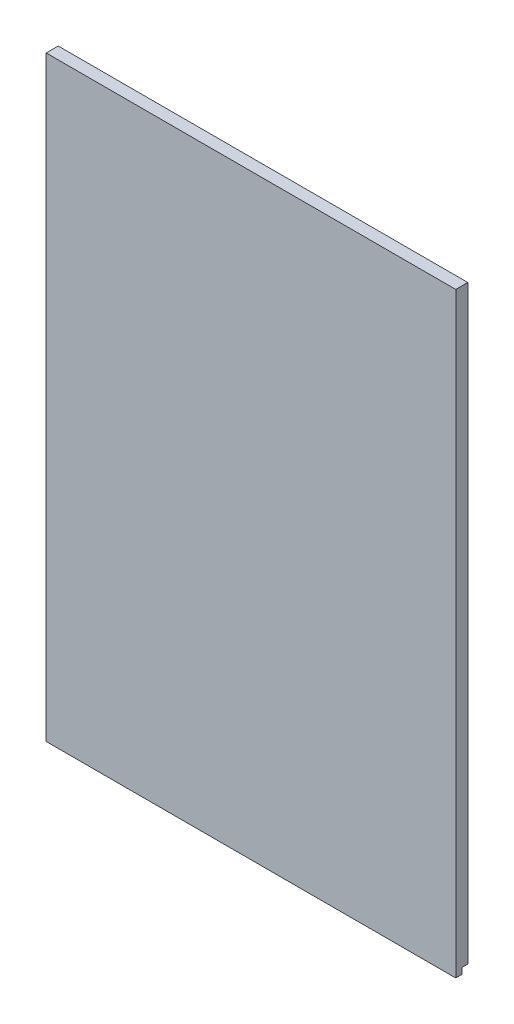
ISO-10303-21;
HEADER;
FILE_DESCRIPTION(('STEP AP214'),'2;1');
FILE_NAME('part.step','',(''),(''),'','','');
FILE_SCHEMA(('AUTOMOTIVE_DESIGN { 1 0 10303 214 1 1 1 1 }'));
ENDSEC;
DATA;
#1=APPLICATION_CONTEXT('core data for automotive mechanical design processes');
#2=APPLICATION_PROTOCOL_DEFINITION('international standard','automotive_design',2000,#1);
#3=PRODUCT_CONTEXT('',#1,'mechanical');
#4=PRODUCT('Part','Part','',(#3));
#5=PRODUCT_RELATED_PRODUCT_CATEGORY('part','',(#4));
#6=PRODUCT_DEFINITION_FORMATION('','',#4);
#7=PRODUCT_DEFINITION_CONTEXT('part definition',#1,'design');
#8=PRODUCT_DEFINITION('design','',#6,#7);
#9=PRODUCT_DEFINITION_SHAPE('','',#8);
#10=(LENGTH_UNIT() NAMED_UNIT(*) SI_UNIT(.MILLI.,.METRE.));
#11=(NAMED_UNIT(*) PLANE_ANGLE_UNIT() SI_UNIT($,.RADIAN.));
#12=(NAMED_UNIT(*) SI_UNIT($,.STERADIAN.) SOLID_ANGLE_UNIT());
#13=UNCERTAINTY_MEASURE_WITH_UNIT(LENGTH_MEASURE(1.E-05),#10,'distance_accuracy_value','');
#14=(GEOMETRIC_REPRESENTATION_CONTEXT(3) GLOBAL_UNCERTAINTY_ASSIGNED_CONTEXT((#13)) GLOBAL_UNIT_ASSIGNED_CONTEXT((#10,
#11,#12)) REPRESENTATION_CONTEXT('',''));
#15=CARTESIAN_POINT('',(0.,0.,0.));
#16=DIRECTION('',(0.,0.,1.));
#17=DIRECTION('',(1.,0.,0.));
#18=AXIS2_PLACEMENT_3D('',#15,#16,#17);
#19=CARTESIAN_POINT('',(0.,0.,2.));
#20=DIRECTION('',(0.,1.,0.));
#21=DIRECTION('',(0.,0.,1.));
#22=AXIS2_PLACEMENT_3D('',#19,#20,#21);
#23=PLANE('',#22);
#24=DIRECTION('',(1.,0.,0.));
#25=VECTOR('',#24,1.);
#26=CARTESIAN_POINT('',(0.,0.,1.));
#27=LINE('',#26,#25);
#28=CARTESIAN_POINT('',(0.,0.,1.));
#29=VERTEX_POINT('',#28);
#30=CARTESIAN_POINT('',(68.,0.,1.));
#31=VERTEX_POINT('',#30);
#32=EDGE_CURVE('E63',#29,#31,#27,.T.);
#33=ORIENTED_EDGE('',*,*,#32,.F.);
#34=DIRECTION('',(0.,0.,-1.));
#35=VECTOR('',#34,1.);
#36=CARTESIAN_POINT('',(0.,0.,2.));
#37=LINE('',#36,#35);
#38=CARTESIAN_POINT('',(0.,0.,0.));
#39=VERTEX_POINT('',#38);
#40=EDGE_CURVE('E455',#29,#39,#37,.T.);
#41=ORIENTED_EDGE('',*,*,#40,.T.);
#42=DIRECTION('',(1.,0.,0.));
#43=VECTOR('',#42,1.);
#44=CARTESIAN_POINT('',(0.,0.,0.));
#45=LINE('',#44,#43);
#46=CARTESIAN_POINT('',(68.,0.,0.));
#47=VERTEX_POINT('',#46);
#48=EDGE_CURVE('E485',#39,#47,#45,.T.);
#49=ORIENTED_EDGE('',*,*,#48,.T.);
#50=DIRECTION('',(0.,0.,-1.));
#51=VECTOR('',#50,1.);
#52=CARTESIAN_POINT('',(68.,0.,2.));
#53=LINE('',#52,#51);
#54=EDGE_CURVE('E501',#31,#47,#53,.T.);
#55=ORIENTED_EDGE('',*,*,#54,.F.);
#56=EDGE_LOOP('',(#33,#41,#49,#55));
#57=FACE_BOUND('',#56,.T.);
#58=ADVANCED_FACE('F45',(#57),#23,.F.);
#59=CARTESIAN_POINT('',(0.,0.,0.));
#60=DIRECTION('',(0.,0.,-1.));
#61=DIRECTION('',(-1.,0.,0.));
#62=AXIS2_PLACEMENT_3D('',#59,#60,#61);
#63=PLANE('',#62);
#64=CARTESIAN_POINT('',(56.2,2.19999999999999,0.));
#65=DIRECTION('',(0.,0.,-1.));
#66=DIRECTION('',(-1.,0.,0.));
#67=AXIS2_PLACEMENT_3D('',#64,#65,#66);
#68=CIRCLE('',#67,0.4);
#69=CARTESIAN_POINT('',(56.2,1.79999999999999,0.));
#70=VERTEX_POINT('',#69);
#71=CARTESIAN_POINT('',(55.8,2.19999999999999,0.));
#72=VERTEX_POINT('',#71);
#73=EDGE_CURVE('E649',#70,#72,#68,.T.);
#74=ORIENTED_EDGE('',*,*,#73,.F.);
#75=DIRECTION('',(-1.,0.,0.));
#76=VECTOR('',#75,1.);
#77=CARTESIAN_POINT('',(58.,1.79999999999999,0.));
#78=LINE('',#77,#76);
#79=CARTESIAN_POINT('',(57.8,1.79999999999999,0.));
#80=VERTEX_POINT('',#79);
#81=EDGE_CURVE('E669',#70,#80,#78,.F.);
#82=ORIENTED_EDGE('',*,*,#81,.T.);
#83=CARTESIAN_POINT('',(57.8,2.19999999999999,0.));
#84=DIRECTION('',(0.,0.,-1.));
#85=DIRECTION('',(-1.,0.,0.));
#86=AXIS2_PLACEMENT_3D('',#83,#84,#85);
#87=CIRCLE('',#86,0.4);
#88=CARTESIAN_POINT('',(58.2,2.19999999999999,0.));
#89=VERTEX_POINT('',#88);
#90=EDGE_CURVE('E666',#89,#80,#87,.T.);
#91=ORIENTED_EDGE('',*,*,#90,.F.);
#92=DIRECTION('',(0.,-1.,0.));
#93=VECTOR('',#92,1.);
#94=CARTESIAN_POINT('',(58.2,3.99999999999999,0.));
#95=LINE('',#94,#93);
#96=CARTESIAN_POINT('',(58.2,3.79999999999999,0.));
#97=VERTEX_POINT('',#96);
#98=EDGE_CURVE('E663',#89,#97,#95,.F.);
#99=ORIENTED_EDGE('',*,*,#98,.T.);
#100=CARTESIAN_POINT('',(57.8,3.79999999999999,0.));
#101=DIRECTION('',(0.,0.,-1.));
#102=DIRECTION('',(-1.,0.,0.));
#103=AXIS2_PLACEMENT_3D('',#100,#101,#102);
#104=CIRCLE('',#103,0.4);
#105=CARTESIAN_POINT('',(57.8,4.19999999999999,0.));
#106=VERTEX_POINT('',#105);
#107=EDGE_CURVE('E659',#106,#97,#104,.T.);
#108=ORIENTED_EDGE('',*,*,#107,.F.);
#109=DIRECTION('',(1.,0.,0.));
#110=VECTOR('',#109,1.);
#111=CARTESIAN_POINT('',(56.,4.19999999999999,0.));
#112=LINE('',#111,#110);
#113=CARTESIAN_POINT('',(55.8,4.19999999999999,0.));
#114=VERTEX_POINT('',#113);
#115=EDGE_CURVE('E656',#106,#114,#112,.F.);
#116=ORIENTED_EDGE('',*,*,#115,.T.);
#117=DIRECTION('',(0.,1.,0.));
#118=VECTOR('',#117,1.);
#119=CARTESIAN_POINT('',(55.8,1.99999999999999,0.));
#120=LINE('',#119,#118);
#121=EDGE_CURVE('E653',#114,#72,#120,.F.);
#122=ORIENTED_EDGE('',*,*,#121,.T.);
#123=EDGE_LOOP('',(#74,#82,#91,#99,#108,#116,#122));
#124=FACE_BOUND('',#123,.T.);
#125=CARTESIAN_POINT('',(2.2,2.2,0.));
#126=DIRECTION('',(0.,0.,-1.));
#127=DIRECTION('',(-1.,0.,0.));
#128=AXIS2_PLACEMENT_3D('',#125,#126,#127);
#129=CIRCLE('',#128,0.4);
#130=CARTESIAN_POINT('',(2.2,1.8,0.));
#131=VERTEX_POINT('',#130);
#132=CARTESIAN_POINT('',(1.8,2.2,0.));
#133=VERTEX_POINT('',#132);
#134=EDGE_CURVE('E621',#131,#133,#129,.T.);
#135=ORIENTED_EDGE('',*,*,#134,.F.);
#136=DIRECTION('',(-1.,0.,0.));
#137=VECTOR('',#136,1.);
#138=CARTESIAN_POINT('',(4.,1.8,0.));
#139=LINE('',#138,#137);
#140=CARTESIAN_POINT('',(3.8,1.8,0.));
#141=VERTEX_POINT('',#140);
#142=EDGE_CURVE('E645',#131,#141,#139,.F.);
#143=ORIENTED_EDGE('',*,*,#142,.T.);
#144=CARTESIAN_POINT('',(3.8,2.2,0.));
#145=DIRECTION('',(0.,0.,-1.));
#146=DIRECTION('',(-1.,0.,0.));
#147=AXIS2_PLACEMENT_3D('',#144,#145,#146);
#148=CIRCLE('',#147,0.4);
#149=CARTESIAN_POINT('',(4.2,2.2,0.));
#150=VERTEX_POINT('',#149);
#151=EDGE_CURVE('E642',#150,#141,#148,.T.);
#152=ORIENTED_EDGE('',*,*,#151,.F.);
#153=DIRECTION('',(0.,-1.,0.));
#154=VECTOR('',#153,1.);
#155=CARTESIAN_POINT('',(4.2,4.,0.));
#156=LINE('',#155,#154);
#157=CARTESIAN_POINT('',(4.2,3.8,0.));
#158=VERTEX_POINT('',#157);
#159=EDGE_CURVE('E639',#150,#158,#156,.F.);
#160=ORIENTED_EDGE('',*,*,#159,.T.);
#161=CARTESIAN_POINT('',(3.8,3.8,0.));
#162=DIRECTION('',(0.,0.,-1.));
#163=DIRECTION('',(-1.,0.,0.));
#164=AXIS2_PLACEMENT_3D('',#161,#162,#163);
#165=CIRCLE('',#164,0.4);
#166=CARTESIAN_POINT('',(3.8,4.2,0.));
#167=VERTEX_POINT('',#166);
#168=EDGE_CURVE('E635',#167,#158,#165,.T.);
#169=ORIENTED_EDGE('',*,*,#168,.F.);
#170=DIRECTION('',(1.,0.,0.));
#171=VECTOR('',#170,1.);
#172=CARTESIAN_POINT('',(2.,4.2,0.));
#173=LINE('',#172,#171);
#174=CARTESIAN_POINT('',(2.2,4.2,0.));
#175=VERTEX_POINT('',#174);
#176=EDGE_CURVE('E632',#167,#175,#173,.F.);
#177=ORIENTED_EDGE('',*,*,#176,.T.);
#178=CARTESIAN_POINT('',(2.2,3.8,0.));
#179=DIRECTION('',(0.,0.,-1.));
#180=DIRECTION('',(-1.,0.,0.));
#181=AXIS2_PLACEMENT_3D('',#178,#179,#180);
#182=CIRCLE('',#181,0.4);
#183=CARTESIAN_POINT('',(1.8,3.8,0.));
#184=VERTEX_POINT('',#183);
#185=EDGE_CURVE('E628',#184,#175,#182,.T.);
#186=ORIENTED_EDGE('',*,*,#185,.F.);
#187=DIRECTION('',(0.,1.,0.));
#188=VECTOR('',#187,1.);
#189=CARTESIAN_POINT('',(1.8,2.,0.));
#190=LINE('',#189,#188);
#191=EDGE_CURVE('E625',#184,#133,#190,.F.);
#192=ORIENTED_EDGE('',*,*,#191,.T.);
#193=EDGE_LOOP('',(#135,#143,#152,#160,#169,#177,#186,#192));
#194=FACE_BOUND('',#193,.T.);
#195=CARTESIAN_POINT('',(65.8,94.2,0.));
#196=DIRECTION('',(0.,0.,-1.));
#197=DIRECTION('',(-1.,0.,0.));
#198=AXIS2_PLACEMENT_3D('',#195,#196,#197);
#199=CIRCLE('',#198,0.4);
#200=CARTESIAN_POINT('',(66.2,94.2,0.));
#201=VERTEX_POINT('',#200);
#202=CARTESIAN_POINT('',(65.8,93.8,0.));
#203=VERTEX_POINT('',#202);
#204=EDGE_CURVE('E589',#201,#203,#199,.T.);
#205=ORIENTED_EDGE('',*,*,#204,.F.);
#206=DIRECTION('',(0.,-1.,0.));
#207=VECTOR('',#206,1.);
#208=CARTESIAN_POINT('',(66.2,96.,0.));
#209=LINE('',#208,#207);
#210=CARTESIAN_POINT('',(66.2,95.8,0.));
#211=VERTEX_POINT('',#210);
#212=EDGE_CURVE('E586',#201,#211,#209,.F.);
#213=ORIENTED_EDGE('',*,*,#212,.T.);
#214=CARTESIAN_POINT('',(65.8,95.8,0.));
#215=DIRECTION('',(0.,0.,-1.));
#216=DIRECTION('',(-1.,0.,0.));
#217=AXIS2_PLACEMENT_3D('',#214,#215,#216);
#218=CIRCLE('',#217,0.4);
#219=CARTESIAN_POINT('',(65.8,96.2,0.));
#220=VERTEX_POINT('',#219);
#221=EDGE_CURVE('E582',#220,#211,#218,.T.);
#222=ORIENTED_EDGE('',*,*,#221,.F.);
#223=DIRECTION('',(1.,0.,0.));
#224=VECTOR('',#223,1.);
#225=CARTESIAN_POINT('',(64.,96.2,0.));
#226=LINE('',#225,#224);
#227=CARTESIAN_POINT('',(64.2,96.2,0.));
#228=VERTEX_POINT('',#227);
#229=EDGE_CURVE('E578',#220,#228,#226,.F.);
#230=ORIENTED_EDGE('',*,*,#229,.T.);
#231=CARTESIAN_POINT('',(64.2,95.8,0.));
#232=DIRECTION('',(0.,0.,-1.));
#233=DIRECTION('',(-1.,0.,0.));
#234=AXIS2_PLACEMENT_3D('',#231,#232,#233);
#235=CIRCLE('',#234,0.4);
#236=CARTESIAN_POINT('',(63.8,95.8,0.));
#237=VERTEX_POINT('',#236);
#238=EDGE_CURVE('E574',#237,#228,#235,.T.);
#239=ORIENTED_EDGE('',*,*,#238,.F.);
#240=DIRECTION('',(0.,1.,0.));
#241=VECTOR('',#240,1.);
#242=CARTESIAN_POINT('',(63.8,94.,0.));
#243=LINE('',#242,#241);
#244=CARTESIAN_POINT('',(63.8,94.2,0.));
#245=VERTEX_POINT('',#244);
#246=EDGE_CURVE('E568',#237,#245,#243,.F.);
#247=ORIENTED_EDGE('',*,*,#246,.T.);
#248=CARTESIAN_POINT('',(64.2,94.2,0.));
#249=DIRECTION('',(0.,0.,-1.));
#250=DIRECTION('',(-1.,0.,0.));
#251=AXIS2_PLACEMENT_3D('',#248,#249,#250);
#252=CIRCLE('',#251,0.4);
#253=CARTESIAN_POINT('',(64.2,93.8,0.));
#254=VERTEX_POINT('',#253);
#255=EDGE_CURVE('E564',#254,#245,#252,.T.);
#256=ORIENTED_EDGE('',*,*,#255,.F.);
#257=DIRECTION('',(-1.,0.,0.));
#258=VECTOR('',#257,1.);
#259=CARTESIAN_POINT('',(66.,93.8,0.));
#260=LINE('',#259,#258);
#261=EDGE_CURVE('E571',#254,#203,#260,.F.);
#262=ORIENTED_EDGE('',*,*,#261,.T.);
#263=EDGE_LOOP('',(#205,#213,#222,#230,#239,#247,#256,#262));
#264=FACE_BOUND('',#263,.T.);
#265=DIRECTION('',(0.,-1.,0.));
#266=VECTOR('',#265,1.);
#267=CARTESIAN_POINT('',(0.,0.,0.));
#268=LINE('',#267,#266);
#269=CARTESIAN_POINT('',(0.,98.,0.));
#270=VERTEX_POINT('',#269);
#271=EDGE_CURVE('E470',#270,#39,#268,.T.);
#272=ORIENTED_EDGE('',*,*,#271,.F.);
#273=DIRECTION('',(-1.,0.,0.));
#274=VECTOR('',#273,1.);
#275=CARTESIAN_POINT('',(0.,98.,0.));
#276=LINE('',#275,#274);
#277=CARTESIAN_POINT('',(68.,98.,0.));
#278=VERTEX_POINT('',#277);
#279=EDGE_CURVE('E476',#278,#270,#276,.T.);
#280=ORIENTED_EDGE('',*,*,#279,.F.);
#281=DIRECTION('',(0.,1.,0.));
#282=VECTOR('',#281,1.);
#283=CARTESIAN_POINT('',(68.,0.,0.));
#284=LINE('',#283,#282);
#285=EDGE_CURVE('E489',#47,#278,#284,.T.);
#286=ORIENTED_EDGE('',*,*,#285,.F.);
#287=ORIENTED_EDGE('',*,*,#48,.F.);
#288=EDGE_LOOP('',(#272,#280,#286,#287));
#289=FACE_BOUND('',#288,.T.);
#290=CARTESIAN_POINT('',(2.2,94.2,0.));
#291=DIRECTION('',(0.,0.,-1.));
#292=DIRECTION('',(-1.,0.,0.));
#293=AXIS2_PLACEMENT_3D('',#290,#291,#292);
#294=CIRCLE('',#293,0.4);
#295=CARTESIAN_POINT('',(2.2,93.8,0.));
#296=VERTEX_POINT('',#295);
#297=CARTESIAN_POINT('',(1.8,94.2,0.));
#298=VERTEX_POINT('',#297);
#299=EDGE_CURVE('E617',#296,#298,#294,.T.);
#300=ORIENTED_EDGE('',*,*,#299,.F.);
#301=DIRECTION('',(-1.,0.,0.));
#302=VECTOR('',#301,1.);
#303=CARTESIAN_POINT('',(4.,93.8,0.));
#304=LINE('',#303,#302);
#305=CARTESIAN_POINT('',(3.8,93.8,0.));
#306=VERTEX_POINT('',#305);
#307=EDGE_CURVE('E613',#296,#306,#304,.F.);
#308=ORIENTED_EDGE('',*,*,#307,.T.);
#309=CARTESIAN_POINT('',(3.8,94.2,0.));
#310=DIRECTION('',(0.,0.,-1.));
#311=DIRECTION('',(-1.,0.,0.));
#312=AXIS2_PLACEMENT_3D('',#309,#310,#311);
#313=CIRCLE('',#312,0.4);
#314=CARTESIAN_POINT('',(4.2,94.2,0.));
#315=VERTEX_POINT('',#314);
#316=EDGE_CURVE('E610',#315,#306,#313,.T.);
#317=ORIENTED_EDGE('',*,*,#316,.F.);
#318=DIRECTION('',(0.,-1.,0.));
#319=VECTOR('',#318,1.);
#320=CARTESIAN_POINT('',(4.2,96.,0.));
#321=LINE('',#320,#319);
#322=CARTESIAN_POINT('',(4.2,95.8,0.));
#323=VERTEX_POINT('',#322);
#324=EDGE_CURVE('E607',#315,#323,#321,.F.);
#325=ORIENTED_EDGE('',*,*,#324,.T.);
#326=CARTESIAN_POINT('',(3.8,95.8,0.));
#327=DIRECTION('',(0.,0.,-1.));
#328=DIRECTION('',(-1.,0.,0.));
#329=AXIS2_PLACEMENT_3D('',#326,#327,#328);
#330=CIRCLE('',#329,0.4);
#331=CARTESIAN_POINT('',(3.8,96.2,0.));
#332=VERTEX_POINT('',#331);
#333=EDGE_CURVE('E603',#332,#323,#330,.T.);
#334=ORIENTED_EDGE('',*,*,#333,.F.);
#335=DIRECTION('',(1.,0.,0.));
#336=VECTOR('',#335,1.);
#337=CARTESIAN_POINT('',(2.,96.2,0.));
#338=LINE('',#337,#336);
#339=CARTESIAN_POINT('',(2.2,96.2,0.));
#340=VERTEX_POINT('',#339);
#341=EDGE_CURVE('E597',#332,#340,#338,.F.);
#342=ORIENTED_EDGE('',*,*,#341,.T.);
#343=CARTESIAN_POINT('',(2.2,95.8,0.));
#344=DIRECTION('',(0.,0.,-1.));
#345=DIRECTION('',(-1.,0.,0.));
#346=AXIS2_PLACEMENT_3D('',#343,#344,#345);
#347=CIRCLE('',#346,0.4);
#348=CARTESIAN_POINT('',(1.8,95.8,0.));
#349=VERTEX_POINT('',#348);
#350=EDGE_CURVE('E593',#349,#340,#347,.T.);
#351=ORIENTED_EDGE('',*,*,#350,.F.);
#352=DIRECTION('',(0.,1.,0.));
#353=VECTOR('',#352,1.);
#354=CARTESIAN_POINT('',(1.8,94.,0.));
#355=LINE('',#354,#353);
#356=EDGE_CURVE('E600',#349,#298,#355,.F.);
#357=ORIENTED_EDGE('',*,*,#356,.T.);
#358=EDGE_LOOP('',(#300,#308,#317,#325,#334,#342,#351,#357));
#359=FACE_BOUND('',#358,.T.);
#360=ADVANCED_FACE('F1258',(#124,#194,#264,#289,#359),#63,.T.);
#361=CARTESIAN_POINT('',(0.,0.,2.));
#362=DIRECTION('',(1.,0.,0.));
#363=DIRECTION('',(0.,0.,-1.));
#364=AXIS2_PLACEMENT_3D('',#361,#362,#363);
#365=PLANE('',#364);
#366=ORIENTED_EDGE('',*,*,#271,.T.);
#367=ORIENTED_EDGE('',*,*,#40,.F.);
#368=DIRECTION('',(0.,1.,0.));
#369=VECTOR('',#368,1.);
#370=CARTESIAN_POINT('',(0.,-1.,1.));
#371=LINE('',#370,#369);
#372=CARTESIAN_POINT('',(0.,-1.,1.));
#373=VERTEX_POINT('',#372);
#374=EDGE_CURVE('E434',#373,#29,#371,.T.);
#375=ORIENTED_EDGE('',*,*,#374,.F.);
#376=DIRECTION('',(0.,0.,-1.));
#377=VECTOR('',#376,1.);
#378=CARTESIAN_POINT('',(0.,-1.,2.));
#379=LINE('',#378,#377);
#380=CARTESIAN_POINT('',(0.,-1.,2.));
#381=VERTEX_POINT('',#380);
#382=EDGE_CURVE('E442',#381,#373,#379,.T.);
#383=ORIENTED_EDGE('',*,*,#382,.F.);
#384=DIRECTION('',(0.,-1.,0.));
#385=VECTOR('',#384,1.);
#386=CARTESIAN_POINT('',(0.,0.,2.));
#387=LINE('',#386,#385);
#388=CARTESIAN_POINT('',(0.,98.,2.));
#389=VERTEX_POINT('',#388);
#390=EDGE_CURVE('E472',#389,#381,#387,.T.);
#391=ORIENTED_EDGE('',*,*,#390,.F.);
#392=DIRECTION('',(0.,0.,-1.));
#393=VECTOR('',#392,1.);
#394=CARTESIAN_POINT('',(0.,98.,2.));
#395=LINE('',#394,#393);
#396=EDGE_CURVE('E482',#389,#270,#395,.T.);
#397=ORIENTED_EDGE('',*,*,#396,.T.);
#398=EDGE_LOOP('',(#366,#367,#375,#383,#391,#397));
#399=FACE_BOUND('',#398,.T.);
#400=ADVANCED_FACE('F454',(#399),#365,.F.);
#401=CARTESIAN_POINT('',(68.,0.,2.));
#402=DIRECTION('',(-1.,0.,0.));
#403=DIRECTION('',(0.,0.,1.));
#404=AXIS2_PLACEMENT_3D('',#401,#402,#403);
#405=PLANE('',#404);
#406=ORIENTED_EDGE('',*,*,#285,.T.);
#407=DIRECTION('',(0.,0.,-1.));
#408=VECTOR('',#407,1.);
#409=CARTESIAN_POINT('',(68.,98.,2.));
#410=LINE('',#409,#408);
#411=CARTESIAN_POINT('',(68.,98.,2.));
#412=VERTEX_POINT('',#411);
#413=EDGE_CURVE('E497',#412,#278,#410,.T.);
#414=ORIENTED_EDGE('',*,*,#413,.F.);
#415=DIRECTION('',(0.,1.,0.));
#416=VECTOR('',#415,1.);
#417=CARTESIAN_POINT('',(68.,0.,2.));
#418=LINE('',#417,#416);
#419=CARTESIAN_POINT('',(68.,-1.,2.));
#420=VERTEX_POINT('',#419);
#421=EDGE_CURVE('E475',#420,#412,#418,.T.);
#422=ORIENTED_EDGE('',*,*,#421,.F.);
#423=DIRECTION('',(0.,0.,1.));
#424=VECTOR('',#423,1.);
#425=CARTESIAN_POINT('',(68.,-1.,2.));
#426=LINE('',#425,#424);
#427=CARTESIAN_POINT('',(68.,-1.,1.));
#428=VERTEX_POINT('',#427);
#429=EDGE_CURVE('E441',#428,#420,#426,.T.);
#430=ORIENTED_EDGE('',*,*,#429,.F.);
#431=DIRECTION('',(0.,1.,0.));
#432=VECTOR('',#431,1.);
#433=CARTESIAN_POINT('',(68.,-1.,1.));
#434=LINE('',#433,#432);
#435=EDGE_CURVE('E436',#428,#31,#434,.T.);
#436=ORIENTED_EDGE('',*,*,#435,.T.);
#437=ORIENTED_EDGE('',*,*,#54,.T.);
#438=EDGE_LOOP('',(#406,#414,#422,#430,#436,#437));
#439=FACE_BOUND('',#438,.T.);
#440=ADVANCED_FACE('F1282',(#439),#405,.F.);
#441=CARTESIAN_POINT('',(0.,98.,2.));
#442=DIRECTION('',(0.,-1.,0.));
#443=DIRECTION('',(0.,0.,-1.));
#444=AXIS2_PLACEMENT_3D('',#441,#442,#443);
#445=PLANE('',#444);
#446=ORIENTED_EDGE('',*,*,#279,.T.);
#447=ORIENTED_EDGE('',*,*,#396,.F.);
#448=DIRECTION('',(-1.,0.,0.));
#449=VECTOR('',#448,1.);
#450=CARTESIAN_POINT('',(0.,98.,2.));
#451=LINE('',#450,#449);
#452=EDGE_CURVE('E479',#412,#389,#451,.T.);
#453=ORIENTED_EDGE('',*,*,#452,.F.);
#454=ORIENTED_EDGE('',*,*,#413,.T.);
#455=EDGE_LOOP('',(#446,#447,#453,#454));
#456=FACE_BOUND('',#455,.T.);
#457=ADVANCED_FACE('F1663',(#456),#445,.F.);
#458=CARTESIAN_POINT('',(0.,0.,2.));
#459=DIRECTION('',(0.,0.,-1.));
#460=DIRECTION('',(-1.,0.,0.));
#461=AXIS2_PLACEMENT_3D('',#458,#459,#460);
#462=PLANE('',#461);
#463=ORIENTED_EDGE('',*,*,#390,.T.);
#464=DIRECTION('',(-1.,0.,0.));
#465=VECTOR('',#464,1.);
#466=CARTESIAN_POINT('',(0.,-1.,2.));
#467=LINE('',#466,#465);
#468=EDGE_CURVE('E448',#420,#381,#467,.T.);
#469=ORIENTED_EDGE('',*,*,#468,.F.);
#470=ORIENTED_EDGE('',*,*,#421,.T.);
#471=ORIENTED_EDGE('',*,*,#452,.T.);
#472=EDGE_LOOP('',(#463,#469,#470,#471));
#473=FACE_BOUND('',#472,.T.);
#474=ADVANCED_FACE('F1671',(#473),#462,.F.);
#475=CARTESIAN_POINT('',(4.,96.,1.));
#476=DIRECTION('',(1.,0.,0.));
#477=DIRECTION('',(0.,0.,-1.));
#478=AXIS2_PLACEMENT_3D('',#475,#476,#477);
#479=PLANE('',#478);
#480=DIRECTION('',(0.,-1.,0.));
#481=VECTOR('',#480,1.);
#482=CARTESIAN_POINT('',(4.,94.,0.2));
#483=LINE('',#482,#481);
#484=CARTESIAN_POINT('',(4.,95.8,0.2));
#485=VERTEX_POINT('',#484);
#486=CARTESIAN_POINT('',(4.,94.2,0.2));
#487=VERTEX_POINT('',#486);
#488=EDGE_CURVE('E757',#485,#487,#483,.T.);
#489=ORIENTED_EDGE('',*,*,#488,.T.);
#490=DIRECTION('',(0.,0.,-1.));
#491=VECTOR('',#490,1.);
#492=CARTESIAN_POINT('',(4.,94.2,1.));
#493=LINE('',#492,#491);
#494=CARTESIAN_POINT('',(4.,94.2,0.8));
#495=VERTEX_POINT('',#494);
#496=EDGE_CURVE('E760',#487,#495,#493,.F.);
#497=ORIENTED_EDGE('',*,*,#496,.T.);
#498=DIRECTION('',(0.,-1.,0.));
#499=VECTOR('',#498,1.);
#500=CARTESIAN_POINT('',(4.,96.,0.8));
#501=LINE('',#500,#499);
#502=CARTESIAN_POINT('',(4.,95.8,0.8));
#503=VERTEX_POINT('',#502);
#504=EDGE_CURVE('E754',#495,#503,#501,.F.);
#505=ORIENTED_EDGE('',*,*,#504,.T.);
#506=DIRECTION('',(0.,0.,-1.));
#507=VECTOR('',#506,1.);
#508=CARTESIAN_POINT('',(4.,95.8,0.));
#509=LINE('',#508,#507);
#510=EDGE_CURVE('E751',#503,#485,#509,.T.);
#511=ORIENTED_EDGE('',*,*,#510,.T.);
#512=EDGE_LOOP('',(#489,#497,#505,#511));
#513=FACE_BOUND('',#512,.T.);
#514=ADVANCED_FACE('F1676',(#513),#479,.F.);
#515=CARTESIAN_POINT('',(4.,96.,1.));
#516=DIRECTION('',(0.,1.,0.));
#517=DIRECTION('',(0.,0.,1.));
#518=AXIS2_PLACEMENT_3D('',#515,#516,#517);
#519=PLANE('',#518);
#520=DIRECTION('',(1.,0.,0.));
#521=VECTOR('',#520,1.);
#522=CARTESIAN_POINT('',(4.,96.,0.2));
#523=LINE('',#522,#521);
#524=CARTESIAN_POINT('',(2.2,96.,0.2));
#525=VERTEX_POINT('',#524);
#526=CARTESIAN_POINT('',(3.8,96.,0.2));
#527=VERTEX_POINT('',#526);
#528=EDGE_CURVE('E790',#525,#527,#523,.T.);
#529=ORIENTED_EDGE('',*,*,#528,.T.);
#530=DIRECTION('',(0.,0.,-1.));
#531=VECTOR('',#530,1.);
#532=CARTESIAN_POINT('',(3.8,96.,1.));
#533=LINE('',#532,#531);
#534=CARTESIAN_POINT('',(3.8,96.,0.8));
#535=VERTEX_POINT('',#534);
#536=EDGE_CURVE('E799',#527,#535,#533,.F.);
#537=ORIENTED_EDGE('',*,*,#536,.T.);
#538=DIRECTION('',(1.,0.,0.));
#539=VECTOR('',#538,1.);
#540=CARTESIAN_POINT('',(4.,96.,0.8));
#541=LINE('',#540,#539);
#542=CARTESIAN_POINT('',(2.2,96.,0.8));
#543=VERTEX_POINT('',#542);
#544=EDGE_CURVE('E796',#535,#543,#541,.F.);
#545=ORIENTED_EDGE('',*,*,#544,.T.);
#546=DIRECTION('',(0.,0.,-1.));
#547=VECTOR('',#546,1.);
#548=CARTESIAN_POINT('',(2.2,96.,0.));
#549=LINE('',#548,#547);
#550=EDGE_CURVE('E793',#543,#525,#549,.T.);
#551=ORIENTED_EDGE('',*,*,#550,.T.);
#552=EDGE_LOOP('',(#529,#537,#545,#551));
#553=FACE_BOUND('',#552,.T.);
#554=ADVANCED_FACE('F1757',(#553),#519,.F.);
#555=CARTESIAN_POINT('',(2.,96.,1.));
#556=DIRECTION('',(-1.,0.,0.));
#557=DIRECTION('',(0.,0.,1.));
#558=AXIS2_PLACEMENT_3D('',#555,#556,#557);
#559=PLANE('',#558);
#560=DIRECTION('',(0.,0.,-1.));
#561=VECTOR('',#560,1.);
#562=CARTESIAN_POINT('',(2.,95.8,1.));
#563=LINE('',#562,#561);
#564=CARTESIAN_POINT('',(2.,95.8,0.2));
#565=VERTEX_POINT('',#564);
#566=CARTESIAN_POINT('',(2.,95.8,0.8));
#567=VERTEX_POINT('',#566);
#568=EDGE_CURVE('E780',#565,#567,#563,.F.);
#569=ORIENTED_EDGE('',*,*,#568,.T.);
#570=DIRECTION('',(0.,1.,0.));
#571=VECTOR('',#570,1.);
#572=CARTESIAN_POINT('',(2.,96.,0.8));
#573=LINE('',#572,#571);
#574=CARTESIAN_POINT('',(2.,94.2,0.8));
#575=VERTEX_POINT('',#574);
#576=EDGE_CURVE('E786',#567,#575,#573,.F.);
#577=ORIENTED_EDGE('',*,*,#576,.T.);
#578=DIRECTION('',(0.,0.,-1.));
#579=VECTOR('',#578,1.);
#580=CARTESIAN_POINT('',(2.,94.2,0.));
#581=LINE('',#580,#579);
#582=CARTESIAN_POINT('',(2.,94.2,0.2));
#583=VERTEX_POINT('',#582);
#584=EDGE_CURVE('E783',#575,#583,#581,.T.);
#585=ORIENTED_EDGE('',*,*,#584,.T.);
#586=DIRECTION('',(0.,1.,0.));
#587=VECTOR('',#586,1.);
#588=CARTESIAN_POINT('',(2.,96.,0.2));
#589=LINE('',#588,#587);
#590=EDGE_CURVE('E777',#583,#565,#589,.T.);
#591=ORIENTED_EDGE('',*,*,#590,.T.);
#592=EDGE_LOOP('',(#569,#577,#585,#591));
#593=FACE_BOUND('',#592,.T.);
#594=ADVANCED_FACE('F1760',(#593),#559,.F.);
#595=CARTESIAN_POINT('',(4.,94.,1.));
#596=DIRECTION('',(0.,-1.,0.));
#597=DIRECTION('',(0.,0.,-1.));
#598=AXIS2_PLACEMENT_3D('',#595,#596,#597);
#599=PLANE('',#598);
#600=DIRECTION('',(-1.,0.,0.));
#601=VECTOR('',#600,1.);
#602=CARTESIAN_POINT('',(4.,94.,0.8));
#603=LINE('',#602,#601);
#604=CARTESIAN_POINT('',(2.2,94.,0.8));
#605=VERTEX_POINT('',#604);
#606=CARTESIAN_POINT('',(3.8,94.,0.8));
#607=VERTEX_POINT('',#606);
#608=EDGE_CURVE('E744',#605,#607,#603,.F.);
#609=ORIENTED_EDGE('',*,*,#608,.T.);
#610=DIRECTION('',(0.,0.,-1.));
#611=VECTOR('',#610,1.);
#612=CARTESIAN_POINT('',(3.8,94.,0.));
#613=LINE('',#612,#611);
#614=CARTESIAN_POINT('',(3.8,94.,0.2));
#615=VERTEX_POINT('',#614);
#616=EDGE_CURVE('E747',#607,#615,#613,.T.);
#617=ORIENTED_EDGE('',*,*,#616,.T.);
#618=DIRECTION('',(-1.,0.,0.));
#619=VECTOR('',#618,1.);
#620=CARTESIAN_POINT('',(2.,94.,0.2));
#621=LINE('',#620,#619);
#622=CARTESIAN_POINT('',(2.2,94.,0.2));
#623=VERTEX_POINT('',#622);
#624=EDGE_CURVE('E738',#615,#623,#621,.T.);
#625=ORIENTED_EDGE('',*,*,#624,.T.);
#626=DIRECTION('',(0.,0.,-1.));
#627=VECTOR('',#626,1.);
#628=CARTESIAN_POINT('',(2.2,94.,1.));
#629=LINE('',#628,#627);
#630=EDGE_CURVE('E741',#623,#605,#629,.F.);
#631=ORIENTED_EDGE('',*,*,#630,.T.);
#632=EDGE_LOOP('',(#609,#617,#625,#631));
#633=FACE_BOUND('',#632,.T.);
#634=ADVANCED_FACE('F1755',(#633),#599,.F.);
#635=CARTESIAN_POINT('',(0.,0.,1.));
#636=DIRECTION('',(0.,0.,-1.));
#637=DIRECTION('',(-1.,0.,0.));
#638=AXIS2_PLACEMENT_3D('',#635,#636,#637);
#639=PLANE('',#638);
#640=DIRECTION('',(0.,-1.,0.));
#641=VECTOR('',#640,1.);
#642=CARTESIAN_POINT('',(3.8,0.,1.));
#643=LINE('',#642,#641);
#644=CARTESIAN_POINT('',(3.8,95.8,1.));
#645=VERTEX_POINT('',#644);
#646=CARTESIAN_POINT('',(3.8,94.2,1.));
#647=VERTEX_POINT('',#646);
#648=EDGE_CURVE('E767',#645,#647,#643,.T.);
#649=ORIENTED_EDGE('',*,*,#648,.T.);
#650=DIRECTION('',(-1.,0.,0.));
#651=VECTOR('',#650,1.);
#652=CARTESIAN_POINT('',(0.,94.2,1.));
#653=LINE('',#652,#651);
#654=CARTESIAN_POINT('',(2.2,94.2,1.));
#655=VERTEX_POINT('',#654);
#656=EDGE_CURVE('E773',#647,#655,#653,.T.);
#657=ORIENTED_EDGE('',*,*,#656,.T.);
#658=DIRECTION('',(0.,1.,0.));
#659=VECTOR('',#658,1.);
#660=CARTESIAN_POINT('',(2.2,0.,1.));
#661=LINE('',#660,#659);
#662=CARTESIAN_POINT('',(2.2,95.8,1.));
#663=VERTEX_POINT('',#662);
#664=EDGE_CURVE('E770',#655,#663,#661,.T.);
#665=ORIENTED_EDGE('',*,*,#664,.T.);
#666=DIRECTION('',(1.,0.,0.));
#667=VECTOR('',#666,1.);
#668=CARTESIAN_POINT('',(0.,95.8,1.));
#669=LINE('',#668,#667);
#670=EDGE_CURVE('E764',#663,#645,#669,.T.);
#671=ORIENTED_EDGE('',*,*,#670,.T.);
#672=EDGE_LOOP('',(#649,#657,#665,#671));
#673=FACE_BOUND('',#672,.T.);
#674=ADVANCED_FACE('F1703',(#673),#639,.T.);
#675=CARTESIAN_POINT('',(56.,1.99999999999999,1.));
#676=DIRECTION('',(0.,-1.,0.));
#677=DIRECTION('',(1.,0.,0.));
#678=AXIS2_PLACEMENT_3D('',#675,#676,#677);
#679=PLANE('',#678);
#680=DIRECTION('',(-1.,0.,0.));
#681=VECTOR('',#680,1.);
#682=CARTESIAN_POINT('',(58.,1.99999999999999,0.8));
#683=LINE('',#682,#681);
#684=CARTESIAN_POINT('',(56.2,1.99999999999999,0.8));
#685=VERTEX_POINT('',#684);
#686=CARTESIAN_POINT('',(57.8,1.99999999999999,0.8));
#687=VERTEX_POINT('',#686);
#688=EDGE_CURVE('E538',#685,#687,#683,.F.);
#689=ORIENTED_EDGE('',*,*,#688,.T.);
#690=DIRECTION('',(0.,0.,-1.));
#691=VECTOR('',#690,1.);
#692=CARTESIAN_POINT('',(57.8,1.99999999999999,0.));
#693=LINE('',#692,#691);
#694=CARTESIAN_POINT('',(57.8,1.99999999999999,0.2));
#695=VERTEX_POINT('',#694);
#696=EDGE_CURVE('E541',#687,#695,#693,.T.);
#697=ORIENTED_EDGE('',*,*,#696,.T.);
#698=DIRECTION('',(-1.,0.,0.));
#699=VECTOR('',#698,1.);
#700=CARTESIAN_POINT('',(56.,1.99999999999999,0.2));
#701=LINE('',#700,#699);
#702=CARTESIAN_POINT('',(56.2,1.99999999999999,0.2));
#703=VERTEX_POINT('',#702);
#704=EDGE_CURVE('E532',#695,#703,#701,.T.);
#705=ORIENTED_EDGE('',*,*,#704,.T.);
#706=DIRECTION('',(0.,0.,-1.));
#707=VECTOR('',#706,1.);
#708=CARTESIAN_POINT('',(56.2,1.99999999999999,1.));
#709=LINE('',#708,#707);
#710=EDGE_CURVE('E535',#703,#685,#709,.F.);
#711=ORIENTED_EDGE('',*,*,#710,.T.);
#712=EDGE_LOOP('',(#689,#697,#705,#711));
#713=FACE_BOUND('',#712,.T.);
#714=ADVANCED_FACE('F1699',(#713),#679,.F.);
#715=CARTESIAN_POINT('',(58.,1.99999999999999,1.));
#716=DIRECTION('',(1.,0.,0.));
#717=DIRECTION('',(0.,0.,-1.));
#718=AXIS2_PLACEMENT_3D('',#715,#716,#717);
#719=PLANE('',#718);
#720=DIRECTION('',(0.,0.,-1.));
#721=VECTOR('',#720,1.);
#722=CARTESIAN_POINT('',(58.,2.19999999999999,1.));
#723=LINE('',#722,#721);
#724=CARTESIAN_POINT('',(58.,2.19999999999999,0.2));
#725=VERTEX_POINT('',#724);
#726=CARTESIAN_POINT('',(58.,2.19999999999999,0.8));
#727=VERTEX_POINT('',#726);
#728=EDGE_CURVE('E525',#725,#727,#723,.F.);
#729=ORIENTED_EDGE('',*,*,#728,.T.);
#730=DIRECTION('',(0.,-1.,0.));
#731=VECTOR('',#730,1.);
#732=CARTESIAN_POINT('',(58.,3.99999999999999,0.8));
#733=LINE('',#732,#731);
#734=CARTESIAN_POINT('',(58.,3.79999999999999,0.8));
#735=VERTEX_POINT('',#734);
#736=EDGE_CURVE('E528',#727,#735,#733,.F.);
#737=ORIENTED_EDGE('',*,*,#736,.T.);
#738=DIRECTION('',(0.,0.,-1.));
#739=VECTOR('',#738,1.);
#740=CARTESIAN_POINT('',(58.,3.79999999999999,0.));
#741=LINE('',#740,#739);
#742=CARTESIAN_POINT('',(58.,3.79999999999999,0.2));
#743=VERTEX_POINT('',#742);
#744=EDGE_CURVE('E522',#735,#743,#741,.T.);
#745=ORIENTED_EDGE('',*,*,#744,.T.);
#746=DIRECTION('',(0.,-1.,0.));
#747=VECTOR('',#746,1.);
#748=CARTESIAN_POINT('',(58.,1.99999999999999,0.2));
#749=LINE('',#748,#747);
#750=EDGE_CURVE('E519',#743,#725,#749,.T.);
#751=ORIENTED_EDGE('',*,*,#750,.T.);
#752=EDGE_LOOP('',(#729,#737,#745,#751));
#753=FACE_BOUND('',#752,.T.);
#754=ADVANCED_FACE('F1702',(#753),#719,.F.);
#755=CARTESIAN_POINT('',(56.,3.99999999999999,1.));
#756=DIRECTION('',(0.,1.,0.));
#757=DIRECTION('',(-1.,0.,0.));
#758=AXIS2_PLACEMENT_3D('',#755,#756,#757);
#759=PLANE('',#758);
#760=DIRECTION('',(0.,0.,-1.));
#761=VECTOR('',#760,1.);
#762=CARTESIAN_POINT('',(57.8,3.99999999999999,1.));
#763=LINE('',#762,#761);
#764=CARTESIAN_POINT('',(57.8,3.99999999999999,0.2));
#765=VERTEX_POINT('',#764);
#766=CARTESIAN_POINT('',(57.8,3.99999999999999,0.8));
#767=VERTEX_POINT('',#766);
#768=EDGE_CURVE('E548',#765,#767,#763,.F.);
#769=ORIENTED_EDGE('',*,*,#768,.T.);
#770=DIRECTION('',(1.,0.,0.));
#771=VECTOR('',#770,1.);
#772=CARTESIAN_POINT('',(56.,3.99999999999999,0.8));
#773=LINE('',#772,#771);
#774=CARTESIAN_POINT('',(56.,3.99999999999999,0.8));
#775=VERTEX_POINT('',#774);
#776=EDGE_CURVE('E552',#767,#775,#773,.F.);
#777=ORIENTED_EDGE('',*,*,#776,.T.);
#778=DIRECTION('',(0.,0.,-1.));
#779=VECTOR('',#778,1.);
#780=CARTESIAN_POINT('',(56.,3.99999999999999,1.));
#781=LINE('',#780,#779);
#782=CARTESIAN_POINT('',(56.,3.99999999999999,0.2));
#783=VERTEX_POINT('',#782);
#784=EDGE_CURVE('E466',#775,#783,#781,.T.);
#785=ORIENTED_EDGE('',*,*,#784,.T.);
#786=DIRECTION('',(1.,0.,0.));
#787=VECTOR('',#786,1.);
#788=CARTESIAN_POINT('',(58.,3.99999999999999,0.2));
#789=LINE('',#788,#787);
#790=EDGE_CURVE('E545',#783,#765,#789,.T.);
#791=ORIENTED_EDGE('',*,*,#790,.T.);
#792=EDGE_LOOP('',(#769,#777,#785,#791));
#793=FACE_BOUND('',#792,.T.);
#794=ADVANCED_FACE('F1709',(#793),#759,.F.);
#795=CARTESIAN_POINT('',(56.,1.99999999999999,1.));
#796=DIRECTION('',(-1.,0.,0.));
#797=DIRECTION('',(0.,0.,1.));
#798=AXIS2_PLACEMENT_3D('',#795,#796,#797);
#799=PLANE('',#798);
#800=ORIENTED_EDGE('',*,*,#784,.F.);
#801=DIRECTION('',(0.,1.,0.));
#802=VECTOR('',#801,1.);
#803=CARTESIAN_POINT('',(56.,1.99999999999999,0.8));
#804=LINE('',#803,#802);
#805=CARTESIAN_POINT('',(56.,2.19999999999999,0.8));
#806=VERTEX_POINT('',#805);
#807=EDGE_CURVE('E561',#775,#806,#804,.F.);
#808=ORIENTED_EDGE('',*,*,#807,.T.);
#809=DIRECTION('',(0.,0.,-1.));
#810=VECTOR('',#809,1.);
#811=CARTESIAN_POINT('',(56.,2.19999999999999,0.));
#812=LINE('',#811,#810);
#813=CARTESIAN_POINT('',(56.,2.19999999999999,0.2));
#814=VERTEX_POINT('',#813);
#815=EDGE_CURVE('E558',#806,#814,#812,.T.);
#816=ORIENTED_EDGE('',*,*,#815,.T.);
#817=DIRECTION('',(0.,1.,0.));
#818=VECTOR('',#817,1.);
#819=CARTESIAN_POINT('',(56.,3.99999999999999,0.2));
#820=LINE('',#819,#818);
#821=EDGE_CURVE('E555',#814,#783,#820,.T.);
#822=ORIENTED_EDGE('',*,*,#821,.T.);
#823=EDGE_LOOP('',(#800,#808,#816,#822));
#824=FACE_BOUND('',#823,.T.);
#825=ADVANCED_FACE('F1705',(#824),#799,.F.);
#826=CARTESIAN_POINT('',(0.,0.,1.));
#827=DIRECTION('',(0.,0.,1.));
#828=DIRECTION('',(1.,0.,0.));
#829=AXIS2_PLACEMENT_3D('',#826,#827,#828);
#830=PLANE('',#829);
#831=DIRECTION('',(1.,0.,0.));
#832=VECTOR('',#831,1.);
#833=CARTESIAN_POINT('',(58.,3.79999999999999,1.));
#834=LINE('',#833,#832);
#835=CARTESIAN_POINT('',(56.2,3.79999999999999,1.));
#836=VERTEX_POINT('',#835);
#837=CARTESIAN_POINT('',(57.8,3.79999999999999,1.));
#838=VERTEX_POINT('',#837);
#839=EDGE_CURVE('E509',#836,#838,#834,.T.);
#840=ORIENTED_EDGE('',*,*,#839,.T.);
#841=DIRECTION('',(0.,-1.,0.));
#842=VECTOR('',#841,1.);
#843=CARTESIAN_POINT('',(57.8,1.99999999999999,1.));
#844=LINE('',#843,#842);
#845=CARTESIAN_POINT('',(57.8,2.19999999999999,1.));
#846=VERTEX_POINT('',#845);
#847=EDGE_CURVE('E515',#838,#846,#844,.T.);
#848=ORIENTED_EDGE('',*,*,#847,.T.);
#849=DIRECTION('',(-1.,0.,0.));
#850=VECTOR('',#849,1.);
#851=CARTESIAN_POINT('',(56.,2.19999999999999,1.));
#852=LINE('',#851,#850);
#853=CARTESIAN_POINT('',(56.2,2.19999999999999,1.));
#854=VERTEX_POINT('',#853);
#855=EDGE_CURVE('E512',#846,#854,#852,.T.);
#856=ORIENTED_EDGE('',*,*,#855,.T.);
#857=DIRECTION('',(0.,1.,0.));
#858=VECTOR('',#857,1.);
#859=CARTESIAN_POINT('',(56.2,3.99999999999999,1.));
#860=LINE('',#859,#858);
#861=EDGE_CURVE('E506',#854,#836,#860,.T.);
#862=ORIENTED_EDGE('',*,*,#861,.T.);
#863=EDGE_LOOP('',(#840,#848,#856,#862));
#864=FACE_BOUND('',#863,.T.);
#865=ADVANCED_FACE('F1708',(#864),#830,.F.);
#866=CARTESIAN_POINT('',(64.,96.,1.));
#867=DIRECTION('',(-1.,0.,0.));
#868=DIRECTION('',(0.,0.,1.));
#869=AXIS2_PLACEMENT_3D('',#866,#867,#868);
#870=PLANE('',#869);
#871=DIRECTION('',(0.,0.,-1.));
#872=VECTOR('',#871,1.);
#873=CARTESIAN_POINT('',(64.,95.8,1.));
#874=LINE('',#873,#872);
#875=CARTESIAN_POINT('',(64.,95.8,0.2));
#876=VERTEX_POINT('',#875);
#877=CARTESIAN_POINT('',(64.,95.8,0.8));
#878=VERTEX_POINT('',#877);
#879=EDGE_CURVE('E858',#876,#878,#874,.F.);
#880=ORIENTED_EDGE('',*,*,#879,.T.);
#881=DIRECTION('',(0.,1.,0.));
#882=VECTOR('',#881,1.);
#883=CARTESIAN_POINT('',(64.,94.,0.8));
#884=LINE('',#883,#882);
#885=CARTESIAN_POINT('',(64.,94.2,0.8));
#886=VERTEX_POINT('',#885);
#887=EDGE_CURVE('E11',#878,#886,#884,.F.);
#888=ORIENTED_EDGE('',*,*,#887,.T.);
#889=DIRECTION('',(0.,0.,-1.));
#890=VECTOR('',#889,1.);
#891=CARTESIAN_POINT('',(64.,94.2,0.));
#892=LINE('',#891,#890);
#893=CARTESIAN_POINT('',(64.,94.2,0.2));
#894=VERTEX_POINT('',#893);
#895=EDGE_CURVE('E55',#886,#894,#892,.T.);
#896=ORIENTED_EDGE('',*,*,#895,.T.);
#897=DIRECTION('',(0.,1.,0.));
#898=VECTOR('',#897,1.);
#899=CARTESIAN_POINT('',(64.,96.,0.2));
#900=LINE('',#899,#898);
#901=EDGE_CURVE('E855',#894,#876,#900,.T.);
#902=ORIENTED_EDGE('',*,*,#901,.T.);
#903=EDGE_LOOP('',(#880,#888,#896,#902));
#904=FACE_BOUND('',#903,.T.);
#905=ADVANCED_FACE('F1243',(#904),#870,.F.);
#906=CARTESIAN_POINT('',(64.,94.,1.));
#907=DIRECTION('',(0.,-1.,0.));
#908=DIRECTION('',(0.,0.,-1.));
#909=AXIS2_PLACEMENT_3D('',#906,#907,#908);
#910=PLANE('',#909);
#911=DIRECTION('',(-1.,0.,0.));
#912=VECTOR('',#911,1.);
#913=CARTESIAN_POINT('',(66.,94.,0.8));
#914=LINE('',#913,#912);
#915=CARTESIAN_POINT('',(64.2,94.,0.8));
#916=VERTEX_POINT('',#915);
#917=CARTESIAN_POINT('',(65.8,94.,0.8));
#918=VERTEX_POINT('',#917);
#919=EDGE_CURVE('E809',#916,#918,#914,.F.);
#920=ORIENTED_EDGE('',*,*,#919,.T.);
#921=DIRECTION('',(0.,0.,-1.));
#922=VECTOR('',#921,1.);
#923=CARTESIAN_POINT('',(65.8,94.,0.));
#924=LINE('',#923,#922);
#925=CARTESIAN_POINT('',(65.8,94.,0.2));
#926=VERTEX_POINT('',#925);
#927=EDGE_CURVE('E812',#918,#926,#924,.T.);
#928=ORIENTED_EDGE('',*,*,#927,.T.);
#929=DIRECTION('',(-1.,0.,0.));
#930=VECTOR('',#929,1.);
#931=CARTESIAN_POINT('',(64.,94.,0.2));
#932=LINE('',#931,#930);
#933=CARTESIAN_POINT('',(64.2,94.,0.2));
#934=VERTEX_POINT('',#933);
#935=EDGE_CURVE('E803',#926,#934,#932,.T.);
#936=ORIENTED_EDGE('',*,*,#935,.T.);
#937=DIRECTION('',(0.,0.,-1.));
#938=VECTOR('',#937,1.);
#939=CARTESIAN_POINT('',(64.2,94.,1.));
#940=LINE('',#939,#938);
#941=EDGE_CURVE('E806',#934,#916,#940,.F.);
#942=ORIENTED_EDGE('',*,*,#941,.T.);
#943=EDGE_LOOP('',(#920,#928,#936,#942));
#944=FACE_BOUND('',#943,.T.);
#945=ADVANCED_FACE('F1741',(#944),#910,.F.);
#946=CARTESIAN_POINT('',(66.,96.,1.));
#947=DIRECTION('',(1.,0.,0.));
#948=DIRECTION('',(0.,0.,-1.));
#949=AXIS2_PLACEMENT_3D('',#946,#947,#948);
#950=PLANE('',#949);
#951=DIRECTION('',(0.,-1.,0.));
#952=VECTOR('',#951,1.);
#953=CARTESIAN_POINT('',(66.,94.,0.2));
#954=LINE('',#953,#952);
#955=CARTESIAN_POINT('',(66.,95.8,0.2));
#956=VERTEX_POINT('',#955);
#957=CARTESIAN_POINT('',(66.,94.2,0.2));
#958=VERTEX_POINT('',#957);
#959=EDGE_CURVE('E816',#956,#958,#954,.T.);
#960=ORIENTED_EDGE('',*,*,#959,.T.);
#961=DIRECTION('',(0.,0.,-1.));
#962=VECTOR('',#961,1.);
#963=CARTESIAN_POINT('',(66.,94.2,1.));
#964=LINE('',#963,#962);
#965=CARTESIAN_POINT('',(66.,94.2,0.8));
#966=VERTEX_POINT('',#965);
#967=EDGE_CURVE('E825',#958,#966,#964,.F.);
#968=ORIENTED_EDGE('',*,*,#967,.T.);
#969=DIRECTION('',(0.,-1.,0.));
#970=VECTOR('',#969,1.);
#971=CARTESIAN_POINT('',(66.,96.,0.8));
#972=LINE('',#971,#970);
#973=CARTESIAN_POINT('',(66.,95.8,0.8));
#974=VERTEX_POINT('',#973);
#975=EDGE_CURVE('E822',#966,#974,#972,.F.);
#976=ORIENTED_EDGE('',*,*,#975,.T.);
#977=DIRECTION('',(0.,0.,-1.));
#978=VECTOR('',#977,1.);
#979=CARTESIAN_POINT('',(66.,95.8,0.));
#980=LINE('',#979,#978);
#981=EDGE_CURVE('E819',#974,#956,#980,.T.);
#982=ORIENTED_EDGE('',*,*,#981,.T.);
#983=EDGE_LOOP('',(#960,#968,#976,#982));
#984=FACE_BOUND('',#983,.T.);
#985=ADVANCED_FACE('F1744',(#984),#950,.F.);
#986=CARTESIAN_POINT('',(64.,96.,1.));
#987=DIRECTION('',(0.,1.,0.));
#988=DIRECTION('',(0.,0.,1.));
#989=AXIS2_PLACEMENT_3D('',#986,#987,#988);
#990=PLANE('',#989);
#991=DIRECTION('',(0.,0.,-1.));
#992=VECTOR('',#991,1.);
#993=CARTESIAN_POINT('',(65.8,96.,1.));
#994=LINE('',#993,#992);
#995=CARTESIAN_POINT('',(65.8,96.,0.2));
#996=VERTEX_POINT('',#995);
#997=CARTESIAN_POINT('',(65.8,96.,0.8));
#998=VERTEX_POINT('',#997);
#999=EDGE_CURVE('E848',#996,#998,#994,.F.);
#1000=ORIENTED_EDGE('',*,*,#999,.T.);
#1001=DIRECTION('',(1.,0.,0.));
#1002=VECTOR('',#1001,1.);
#1003=CARTESIAN_POINT('',(64.,96.,0.8));
#1004=LINE('',#1003,#1002);
#1005=CARTESIAN_POINT('',(64.2,96.,0.8));
#1006=VERTEX_POINT('',#1005);
#1007=EDGE_CURVE('E851',#998,#1006,#1004,.F.);
#1008=ORIENTED_EDGE('',*,*,#1007,.T.);
#1009=DIRECTION('',(0.,0.,-1.));
#1010=VECTOR('',#1009,1.);
#1011=CARTESIAN_POINT('',(64.2,96.,0.));
#1012=LINE('',#1011,#1010);
#1013=CARTESIAN_POINT('',(64.2,96.,0.2));
#1014=VERTEX_POINT('',#1013);
#1015=EDGE_CURVE('E842',#1006,#1014,#1012,.T.);
#1016=ORIENTED_EDGE('',*,*,#1015,.T.);
#1017=DIRECTION('',(1.,0.,0.));
#1018=VECTOR('',#1017,1.);
#1019=CARTESIAN_POINT('',(66.,96.,0.2));
#1020=LINE('',#1019,#1018);
#1021=EDGE_CURVE('E845',#1014,#996,#1020,.T.);
#1022=ORIENTED_EDGE('',*,*,#1021,.T.);
#1023=EDGE_LOOP('',(#1000,#1008,#1016,#1022));
#1024=FACE_BOUND('',#1023,.T.);
#1025=ADVANCED_FACE('F1216',(#1024),#990,.F.);
#1026=CARTESIAN_POINT('',(0.,0.,1.));
#1027=DIRECTION('',(0.,0.,1.));
#1028=DIRECTION('',(1.,0.,0.));
#1029=AXIS2_PLACEMENT_3D('',#1026,#1027,#1028);
#1030=PLANE('',#1029);
#1031=DIRECTION('',(1.,0.,0.));
#1032=VECTOR('',#1031,1.);
#1033=CARTESIAN_POINT('',(66.,95.8,1.));
#1034=LINE('',#1033,#1032);
#1035=CARTESIAN_POINT('',(64.2,95.8,1.));
#1036=VERTEX_POINT('',#1035);
#1037=CARTESIAN_POINT('',(65.8,95.8,1.));
#1038=VERTEX_POINT('',#1037);
#1039=EDGE_CURVE('E835',#1036,#1038,#1034,.T.);
#1040=ORIENTED_EDGE('',*,*,#1039,.T.);
#1041=DIRECTION('',(0.,-1.,0.));
#1042=VECTOR('',#1041,1.);
#1043=CARTESIAN_POINT('',(65.8,94.,1.));
#1044=LINE('',#1043,#1042);
#1045=CARTESIAN_POINT('',(65.8,94.2,1.));
#1046=VERTEX_POINT('',#1045);
#1047=EDGE_CURVE('E838',#1038,#1046,#1044,.T.);
#1048=ORIENTED_EDGE('',*,*,#1047,.T.);
#1049=DIRECTION('',(-1.,0.,0.));
#1050=VECTOR('',#1049,1.);
#1051=CARTESIAN_POINT('',(64.,94.2,1.));
#1052=LINE('',#1051,#1050);
#1053=CARTESIAN_POINT('',(64.2,94.2,1.));
#1054=VERTEX_POINT('',#1053);
#1055=EDGE_CURVE('E832',#1046,#1054,#1052,.T.);
#1056=ORIENTED_EDGE('',*,*,#1055,.T.);
#1057=DIRECTION('',(0.,1.,0.));
#1058=VECTOR('',#1057,1.);
#1059=CARTESIAN_POINT('',(64.2,96.,1.));
#1060=LINE('',#1059,#1058);
#1061=EDGE_CURVE('E829',#1054,#1036,#1060,.T.);
#1062=ORIENTED_EDGE('',*,*,#1061,.T.);
#1063=EDGE_LOOP('',(#1040,#1048,#1056,#1062));
#1064=FACE_BOUND('',#1063,.T.);
#1065=ADVANCED_FACE('F1237',(#1064),#1030,.F.);
#1066=CARTESIAN_POINT('',(4.,2.,1.));
#1067=DIRECTION('',(1.,0.,0.));
#1068=DIRECTION('',(0.,0.,-1.));
#1069=AXIS2_PLACEMENT_3D('',#1066,#1067,#1068);
#1070=PLANE('',#1069);
#1071=DIRECTION('',(0.,-1.,0.));
#1072=VECTOR('',#1071,1.);
#1073=CARTESIAN_POINT('',(4.,2.,0.2));
#1074=LINE('',#1073,#1072);
#1075=CARTESIAN_POINT('',(4.,3.8,0.2));
#1076=VERTEX_POINT('',#1075);
#1077=CARTESIAN_POINT('',(4.,2.2,0.2));
#1078=VERTEX_POINT('',#1077);
#1079=EDGE_CURVE('E692',#1076,#1078,#1074,.T.);
#1080=ORIENTED_EDGE('',*,*,#1079,.T.);
#1081=DIRECTION('',(0.,0.,-1.));
#1082=VECTOR('',#1081,1.);
#1083=CARTESIAN_POINT('',(4.,2.2,1.));
#1084=LINE('',#1083,#1082);
#1085=CARTESIAN_POINT('',(4.,2.2,0.8));
#1086=VERTEX_POINT('',#1085);
#1087=EDGE_CURVE('E695',#1078,#1086,#1084,.F.);
#1088=ORIENTED_EDGE('',*,*,#1087,.T.);
#1089=DIRECTION('',(0.,-1.,0.));
#1090=VECTOR('',#1089,1.);
#1091=CARTESIAN_POINT('',(4.,4.,0.8));
#1092=LINE('',#1091,#1090);
#1093=CARTESIAN_POINT('',(4.,3.8,0.8));
#1094=VERTEX_POINT('',#1093);
#1095=EDGE_CURVE('E689',#1086,#1094,#1092,.F.);
#1096=ORIENTED_EDGE('',*,*,#1095,.T.);
#1097=DIRECTION('',(0.,0.,-1.));
#1098=VECTOR('',#1097,1.);
#1099=CARTESIAN_POINT('',(4.,3.8,0.));
#1100=LINE('',#1099,#1098);
#1101=EDGE_CURVE('E686',#1094,#1076,#1100,.T.);
#1102=ORIENTED_EDGE('',*,*,#1101,.T.);
#1103=EDGE_LOOP('',(#1080,#1088,#1096,#1102));
#1104=FACE_BOUND('',#1103,.T.);
#1105=ADVANCED_FACE('F1720',(#1104),#1070,.F.);
#1106=CARTESIAN_POINT('',(4.,4.,1.));
#1107=DIRECTION('',(0.,1.,0.));
#1108=DIRECTION('',(0.,0.,1.));
#1109=AXIS2_PLACEMENT_3D('',#1106,#1107,#1108);
#1110=PLANE('',#1109);
#1111=DIRECTION('',(1.,0.,0.));
#1112=VECTOR('',#1111,1.);
#1113=CARTESIAN_POINT('',(4.,4.,0.2));
#1114=LINE('',#1113,#1112);
#1115=CARTESIAN_POINT('',(2.2,4.,0.2));
#1116=VERTEX_POINT('',#1115);
#1117=CARTESIAN_POINT('',(3.8,4.,0.2));
#1118=VERTEX_POINT('',#1117);
#1119=EDGE_CURVE('E725',#1116,#1118,#1114,.T.);
#1120=ORIENTED_EDGE('',*,*,#1119,.T.);
#1121=DIRECTION('',(0.,0.,-1.));
#1122=VECTOR('',#1121,1.);
#1123=CARTESIAN_POINT('',(3.8,4.,1.));
#1124=LINE('',#1123,#1122);
#1125=CARTESIAN_POINT('',(3.8,4.,0.8));
#1126=VERTEX_POINT('',#1125);
#1127=EDGE_CURVE('E734',#1118,#1126,#1124,.F.);
#1128=ORIENTED_EDGE('',*,*,#1127,.T.);
#1129=DIRECTION('',(1.,0.,0.));
#1130=VECTOR('',#1129,1.);
#1131=CARTESIAN_POINT('',(2.,4.,0.8));
#1132=LINE('',#1131,#1130);
#1133=CARTESIAN_POINT('',(2.2,4.,0.8));
#1134=VERTEX_POINT('',#1133);
#1135=EDGE_CURVE('E731',#1126,#1134,#1132,.F.);
#1136=ORIENTED_EDGE('',*,*,#1135,.T.);
#1137=DIRECTION('',(0.,0.,-1.));
#1138=VECTOR('',#1137,1.);
#1139=CARTESIAN_POINT('',(2.2,4.,0.));
#1140=LINE('',#1139,#1138);
#1141=EDGE_CURVE('E728',#1134,#1116,#1140,.T.);
#1142=ORIENTED_EDGE('',*,*,#1141,.T.);
#1143=EDGE_LOOP('',(#1120,#1128,#1136,#1142));
#1144=FACE_BOUND('',#1143,.T.);
#1145=ADVANCED_FACE('F1723',(#1144),#1110,.F.);
#1146=CARTESIAN_POINT('',(2.,2.,1.));
#1147=DIRECTION('',(-1.,0.,0.));
#1148=DIRECTION('',(0.,0.,1.));
#1149=AXIS2_PLACEMENT_3D('',#1146,#1147,#1148);
#1150=PLANE('',#1149);
#1151=DIRECTION('',(0.,0.,-1.));
#1152=VECTOR('',#1151,1.);
#1153=CARTESIAN_POINT('',(2.,3.8,1.));
#1154=LINE('',#1153,#1152);
#1155=CARTESIAN_POINT('',(2.,3.8,0.2));
#1156=VERTEX_POINT('',#1155);
#1157=CARTESIAN_POINT('',(2.,3.8,0.8));
#1158=VERTEX_POINT('',#1157);
#1159=EDGE_CURVE('E715',#1156,#1158,#1154,.F.);
#1160=ORIENTED_EDGE('',*,*,#1159,.T.);
#1161=DIRECTION('',(0.,1.,0.));
#1162=VECTOR('',#1161,1.);
#1163=CARTESIAN_POINT('',(2.,2.,0.8));
#1164=LINE('',#1163,#1162);
#1165=CARTESIAN_POINT('',(2.,2.2,0.8));
#1166=VERTEX_POINT('',#1165);
#1167=EDGE_CURVE('E721',#1158,#1166,#1164,.F.);
#1168=ORIENTED_EDGE('',*,*,#1167,.T.);
#1169=DIRECTION('',(0.,0.,-1.));
#1170=VECTOR('',#1169,1.);
#1171=CARTESIAN_POINT('',(2.,2.2,0.));
#1172=LINE('',#1171,#1170);
#1173=CARTESIAN_POINT('',(2.,2.2,0.2));
#1174=VERTEX_POINT('',#1173);
#1175=EDGE_CURVE('E718',#1166,#1174,#1172,.T.);
#1176=ORIENTED_EDGE('',*,*,#1175,.T.);
#1177=DIRECTION('',(0.,1.,0.));
#1178=VECTOR('',#1177,1.);
#1179=CARTESIAN_POINT('',(2.,4.,0.2));
#1180=LINE('',#1179,#1178);
#1181=EDGE_CURVE('E712',#1174,#1156,#1180,.T.);
#1182=ORIENTED_EDGE('',*,*,#1181,.T.);
#1183=EDGE_LOOP('',(#1160,#1168,#1176,#1182));
#1184=FACE_BOUND('',#1183,.T.);
#1185=ADVANCED_FACE('F1728',(#1184),#1150,.F.);
#1186=CARTESIAN_POINT('',(4.,2.,1.));
#1187=DIRECTION('',(0.,-1.,0.));
#1188=DIRECTION('',(0.,0.,-1.));
#1189=AXIS2_PLACEMENT_3D('',#1186,#1187,#1188);
#1190=PLANE('',#1189);
#1191=DIRECTION('',(-1.,0.,0.));
#1192=VECTOR('',#1191,1.);
#1193=CARTESIAN_POINT('',(4.,2.,0.8));
#1194=LINE('',#1193,#1192);
#1195=CARTESIAN_POINT('',(2.2,2.,0.8));
#1196=VERTEX_POINT('',#1195);
#1197=CARTESIAN_POINT('',(3.8,2.,0.8));
#1198=VERTEX_POINT('',#1197);
#1199=EDGE_CURVE('E679',#1196,#1198,#1194,.F.);
#1200=ORIENTED_EDGE('',*,*,#1199,.T.);
#1201=DIRECTION('',(0.,0.,-1.));
#1202=VECTOR('',#1201,1.);
#1203=CARTESIAN_POINT('',(3.8,2.,0.));
#1204=LINE('',#1203,#1202);
#1205=CARTESIAN_POINT('',(3.8,2.,0.2));
#1206=VERTEX_POINT('',#1205);
#1207=EDGE_CURVE('E682',#1198,#1206,#1204,.T.);
#1208=ORIENTED_EDGE('',*,*,#1207,.T.);
#1209=DIRECTION('',(-1.,0.,0.));
#1210=VECTOR('',#1209,1.);
#1211=CARTESIAN_POINT('',(2.,2.,0.2));
#1212=LINE('',#1211,#1210);
#1213=CARTESIAN_POINT('',(2.2,2.,0.2));
#1214=VERTEX_POINT('',#1213);
#1215=EDGE_CURVE('E673',#1206,#1214,#1212,.T.);
#1216=ORIENTED_EDGE('',*,*,#1215,.T.);
#1217=DIRECTION('',(0.,0.,-1.));
#1218=VECTOR('',#1217,1.);
#1219=CARTESIAN_POINT('',(2.2,2.,1.));
#1220=LINE('',#1219,#1218);
#1221=EDGE_CURVE('E676',#1214,#1196,#1220,.F.);
#1222=ORIENTED_EDGE('',*,*,#1221,.T.);
#1223=EDGE_LOOP('',(#1200,#1208,#1216,#1222));
#1224=FACE_BOUND('',#1223,.T.);
#1225=ADVANCED_FACE('F1725',(#1224),#1190,.F.);
#1226=CARTESIAN_POINT('',(0.,0.,1.));
#1227=DIRECTION('',(0.,0.,1.));
#1228=DIRECTION('',(1.,0.,0.));
#1229=AXIS2_PLACEMENT_3D('',#1226,#1227,#1228);
#1230=PLANE('',#1229);
#1231=DIRECTION('',(0.,-1.,0.));
#1232=VECTOR('',#1231,1.);
#1233=CARTESIAN_POINT('',(3.8,2.,1.));
#1234=LINE('',#1233,#1232);
#1235=CARTESIAN_POINT('',(3.8,3.8,1.));
#1236=VERTEX_POINT('',#1235);
#1237=CARTESIAN_POINT('',(3.8,2.2,1.));
#1238=VERTEX_POINT('',#1237);
#1239=EDGE_CURVE('E702',#1236,#1238,#1234,.T.);
#1240=ORIENTED_EDGE('',*,*,#1239,.T.);
#1241=DIRECTION('',(-1.,0.,0.));
#1242=VECTOR('',#1241,1.);
#1243=CARTESIAN_POINT('',(2.,2.2,1.));
#1244=LINE('',#1243,#1242);
#1245=CARTESIAN_POINT('',(2.2,2.2,1.));
#1246=VERTEX_POINT('',#1245);
#1247=EDGE_CURVE('E708',#1238,#1246,#1244,.T.);
#1248=ORIENTED_EDGE('',*,*,#1247,.T.);
#1249=DIRECTION('',(0.,1.,0.));
#1250=VECTOR('',#1249,1.);
#1251=CARTESIAN_POINT('',(2.2,4.,1.));
#1252=LINE('',#1251,#1250);
#1253=CARTESIAN_POINT('',(2.2,3.8,1.));
#1254=VERTEX_POINT('',#1253);
#1255=EDGE_CURVE('E705',#1246,#1254,#1252,.T.);
#1256=ORIENTED_EDGE('',*,*,#1255,.T.);
#1257=DIRECTION('',(1.,0.,0.));
#1258=VECTOR('',#1257,1.);
#1259=CARTESIAN_POINT('',(4.,3.8,1.));
#1260=LINE('',#1259,#1258);
#1261=EDGE_CURVE('E699',#1254,#1236,#1260,.T.);
#1262=ORIENTED_EDGE('',*,*,#1261,.T.);
#1263=EDGE_LOOP('',(#1240,#1248,#1256,#1262));
#1264=FACE_BOUND('',#1263,.T.);
#1265=ADVANCED_FACE('F1353',(#1264),#1230,.F.);
#1266=CARTESIAN_POINT('',(55.8,1.99999999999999,0.2));
#1267=DIRECTION('',(0.,-1.,0.));
#1268=DIRECTION('',(0.,0.,-1.));
#1269=AXIS2_PLACEMENT_3D('',#1266,#1267,#1268);
#1270=CYLINDRICAL_SURFACE('',#1269,0.2);
#1271=CARTESIAN_POINT('',(55.8,2.19999999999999,0.2));
#1272=DIRECTION('',(0.,-1.,0.));
#1273=DIRECTION('',(0.,0.,-1.));
#1274=AXIS2_PLACEMENT_3D('',#1271,#1272,#1273);
#1275=CIRCLE('',#1274,0.2);
#1276=EDGE_CURVE('E471',#72,#814,#1275,.T.);
#1277=ORIENTED_EDGE('',*,*,#1276,.F.);
#1278=ORIENTED_EDGE('',*,*,#121,.F.);
#1279=CARTESIAN_POINT('',(55.8,4.19999999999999,0.2));
#1280=DIRECTION('',(-0.707106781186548,-0.707106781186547,0.));
#1281=DIRECTION('',(-0.707106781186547,0.707106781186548,0.));
#1282=AXIS2_PLACEMENT_3D('',#1279,#1280,#1281);
#1283=ELLIPSE('',#1282,0.282842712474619,0.2);
#1284=EDGE_CURVE('E932',#783,#114,#1283,.F.);
#1285=ORIENTED_EDGE('',*,*,#1284,.F.);
#1286=ORIENTED_EDGE('',*,*,#821,.F.);
#1287=EDGE_LOOP('',(#1277,#1278,#1285,#1286));
#1288=FACE_BOUND('',#1287,.T.);
#1289=ADVANCED_FACE('F1349',(#1288),#1270,.T.);
#1290=CARTESIAN_POINT('',(56.2,2.19999999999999,0.2));
#1291=DIRECTION('',(0.,0.,-1.));
#1292=DIRECTION('',(-1.,0.,0.));
#1293=AXIS2_PLACEMENT_3D('',#1290,#1291,#1292);
#1294=TOROIDAL_SURFACE('',#1293,0.4,0.2);
#1295=ORIENTED_EDGE('',*,*,#73,.T.);
#1296=ORIENTED_EDGE('',*,*,#1276,.T.);
#1297=CARTESIAN_POINT('',(56.2,2.19999999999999,0.2));
#1298=DIRECTION('',(0.,0.,-1.));
#1299=DIRECTION('',(-1.,0.,0.));
#1300=AXIS2_PLACEMENT_3D('',#1297,#1298,#1299);
#1301=CIRCLE('',#1300,0.2);
#1302=EDGE_CURVE('E928',#703,#814,#1301,.T.);
#1303=ORIENTED_EDGE('',*,*,#1302,.F.);
#1304=CARTESIAN_POINT('',(56.2,1.79999999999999,0.2));
#1305=DIRECTION('',(-1.,0.,0.));
#1306=DIRECTION('',(0.,0.,1.));
#1307=AXIS2_PLACEMENT_3D('',#1304,#1305,#1306);
#1308=CIRCLE('',#1307,0.2);
#1309=EDGE_CURVE('E924',#70,#703,#1308,.F.);
#1310=ORIENTED_EDGE('',*,*,#1309,.F.);
#1311=EDGE_LOOP('',(#1295,#1296,#1303,#1310));
#1312=FACE_BOUND('',#1311,.T.);
#1313=ADVANCED_FACE('F1345',(#1312),#1294,.T.);
#1314=CARTESIAN_POINT('',(56.,4.19999999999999,0.2));
#1315=DIRECTION('',(-1.,0.,0.));
#1316=DIRECTION('',(0.,-1.,0.));
#1317=AXIS2_PLACEMENT_3D('',#1314,#1315,#1316);
#1318=CYLINDRICAL_SURFACE('',#1317,0.2);
#1319=ORIENTED_EDGE('',*,*,#1284,.T.);
#1320=ORIENTED_EDGE('',*,*,#115,.F.);
#1321=CARTESIAN_POINT('',(57.8,4.19999999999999,0.2));
#1322=DIRECTION('',(1.,0.,0.));
#1323=DIRECTION('',(0.,0.,-1.));
#1324=AXIS2_PLACEMENT_3D('',#1321,#1322,#1323);
#1325=CIRCLE('',#1324,0.2);
#1326=EDGE_CURVE('E916',#765,#106,#1325,.T.);
#1327=ORIENTED_EDGE('',*,*,#1326,.F.);
#1328=ORIENTED_EDGE('',*,*,#790,.F.);
#1329=EDGE_LOOP('',(#1319,#1320,#1327,#1328));
#1330=FACE_BOUND('',#1329,.T.);
#1331=ADVANCED_FACE('F1341',(#1330),#1318,.T.);
#1332=CARTESIAN_POINT('',(56.2,2.19999999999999,1.));
#1333=DIRECTION('',(0.,0.,1.));
#1334=DIRECTION('',(1.,0.,0.));
#1335=AXIS2_PLACEMENT_3D('',#1332,#1333,#1334);
#1336=CYLINDRICAL_SURFACE('',#1335,0.2);
#1337=ORIENTED_EDGE('',*,*,#1302,.T.);
#1338=ORIENTED_EDGE('',*,*,#815,.F.);
#1339=CARTESIAN_POINT('',(56.2,2.19999999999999,0.8));
#1340=DIRECTION('',(0.,0.,-1.));
#1341=DIRECTION('',(-1.,0.,0.));
#1342=AXIS2_PLACEMENT_3D('',#1339,#1340,#1341);
#1343=CIRCLE('',#1342,0.2);
#1344=EDGE_CURVE('E908',#685,#806,#1343,.T.);
#1345=ORIENTED_EDGE('',*,*,#1344,.F.);
#1346=ORIENTED_EDGE('',*,*,#710,.F.);
#1347=EDGE_LOOP('',(#1337,#1338,#1345,#1346));
#1348=FACE_BOUND('',#1347,.T.);
#1349=ADVANCED_FACE('F1337',(#1348),#1336,.F.);
#1350=CARTESIAN_POINT('',(56.,1.79999999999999,0.2));
#1351=DIRECTION('',(1.,0.,0.));
#1352=DIRECTION('',(0.,1.,0.));
#1353=AXIS2_PLACEMENT_3D('',#1350,#1351,#1352);
#1354=CYLINDRICAL_SURFACE('',#1353,0.2);
#1355=ORIENTED_EDGE('',*,*,#1309,.T.);
#1356=ORIENTED_EDGE('',*,*,#704,.F.);
#1357=CARTESIAN_POINT('',(57.8,1.79999999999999,0.2));
#1358=DIRECTION('',(1.,0.,0.));
#1359=DIRECTION('',(0.,0.,-1.));
#1360=AXIS2_PLACEMENT_3D('',#1357,#1358,#1359);
#1361=CIRCLE('',#1360,0.2);
#1362=EDGE_CURVE('E904',#80,#695,#1361,.T.);
#1363=ORIENTED_EDGE('',*,*,#1362,.F.);
#1364=ORIENTED_EDGE('',*,*,#81,.F.);
#1365=EDGE_LOOP('',(#1355,#1356,#1363,#1364));
#1366=FACE_BOUND('',#1365,.T.);
#1367=ADVANCED_FACE('F1333',(#1366),#1354,.T.);
#1368=CARTESIAN_POINT('',(58.2,1.99999999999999,0.2));
#1369=DIRECTION('',(0.,1.,0.));
#1370=DIRECTION('',(0.,0.,1.));
#1371=AXIS2_PLACEMENT_3D('',#1368,#1369,#1370);
#1372=CYLINDRICAL_SURFACE('',#1371,0.2);
#1373=CARTESIAN_POINT('',(58.2,3.79999999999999,0.2));
#1374=DIRECTION('',(0.,1.,0.));
#1375=DIRECTION('',(0.,0.,1.));
#1376=AXIS2_PLACEMENT_3D('',#1373,#1374,#1375);
#1377=CIRCLE('',#1376,0.2);
#1378=EDGE_CURVE('E920',#97,#743,#1377,.T.);
#1379=ORIENTED_EDGE('',*,*,#1378,.F.);
#1380=ORIENTED_EDGE('',*,*,#98,.F.);
#1381=CARTESIAN_POINT('',(58.2,2.19999999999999,0.2));
#1382=DIRECTION('',(0.,-1.,0.));
#1383=DIRECTION('',(0.,0.,-1.));
#1384=AXIS2_PLACEMENT_3D('',#1381,#1382,#1383);
#1385=CIRCLE('',#1384,0.2);
#1386=EDGE_CURVE('E900',#725,#89,#1385,.T.);
#1387=ORIENTED_EDGE('',*,*,#1386,.F.);
#1388=ORIENTED_EDGE('',*,*,#750,.F.);
#1389=EDGE_LOOP('',(#1379,#1380,#1387,#1388));
#1390=FACE_BOUND('',#1389,.T.);
#1391=ADVANCED_FACE('F1329',(#1390),#1372,.T.);
#1392=CARTESIAN_POINT('',(57.8,3.79999999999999,0.2));
#1393=DIRECTION('',(0.,0.,-1.));
#1394=DIRECTION('',(-1.,0.,0.));
#1395=AXIS2_PLACEMENT_3D('',#1392,#1393,#1394);
#1396=TOROIDAL_SURFACE('',#1395,0.4,0.2);
#1397=ORIENTED_EDGE('',*,*,#107,.T.);
#1398=ORIENTED_EDGE('',*,*,#1378,.T.);
#1399=CARTESIAN_POINT('',(57.8,3.79999999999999,0.2));
#1400=DIRECTION('',(0.,0.,-1.));
#1401=DIRECTION('',(-1.,0.,0.));
#1402=AXIS2_PLACEMENT_3D('',#1399,#1400,#1401);
#1403=CIRCLE('',#1402,0.2);
#1404=EDGE_CURVE('E896',#765,#743,#1403,.T.);
#1405=ORIENTED_EDGE('',*,*,#1404,.F.);
#1406=ORIENTED_EDGE('',*,*,#1326,.T.);
#1407=EDGE_LOOP('',(#1397,#1398,#1405,#1406));
#1408=FACE_BOUND('',#1407,.T.);
#1409=ADVANCED_FACE('F1325',(#1408),#1396,.T.);
#1410=CARTESIAN_POINT('',(56.2,0.,0.8));
#1411=DIRECTION('',(0.,-1.,0.));
#1412=DIRECTION('',(0.,0.,-1.));
#1413=AXIS2_PLACEMENT_3D('',#1410,#1411,#1412);
#1414=CYLINDRICAL_SURFACE('',#1413,0.2);
#1415=CARTESIAN_POINT('',(56.2,2.19999999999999,0.8));
#1416=DIRECTION('',(0.,1.,0.));
#1417=DIRECTION('',(0.,0.,1.));
#1418=AXIS2_PLACEMENT_3D('',#1415,#1416,#1417);
#1419=CIRCLE('',#1418,0.2);
#1420=EDGE_CURVE('E912',#806,#854,#1419,.T.);
#1421=ORIENTED_EDGE('',*,*,#1420,.F.);
#1422=ORIENTED_EDGE('',*,*,#807,.F.);
#1423=CARTESIAN_POINT('',(56.2,3.79999999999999,0.8));
#1424=DIRECTION('',(-0.707106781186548,-0.707106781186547,0.));
#1425=DIRECTION('',(-0.707106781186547,0.707106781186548,0.));
#1426=AXIS2_PLACEMENT_3D('',#1423,#1424,#1425);
#1427=ELLIPSE('',#1426,0.282842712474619,0.2);
#1428=EDGE_CURVE('E892',#836,#775,#1427,.T.);
#1429=ORIENTED_EDGE('',*,*,#1428,.F.);
#1430=ORIENTED_EDGE('',*,*,#861,.F.);
#1431=EDGE_LOOP('',(#1421,#1422,#1429,#1430));
#1432=FACE_BOUND('',#1431,.T.);
#1433=ADVANCED_FACE('F1321',(#1432),#1414,.F.);
#1434=CARTESIAN_POINT('',(56.2,2.19999999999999,0.8));
#1435=DIRECTION('',(-1.,0.,0.));
#1436=DIRECTION('',(0.,0.,1.));
#1437=AXIS2_PLACEMENT_3D('',#1434,#1435,#1436);
#1438=SPHERICAL_SURFACE('',#1437,0.2);
#1439=ORIENTED_EDGE('',*,*,#1344,.T.);
#1440=ORIENTED_EDGE('',*,*,#1420,.T.);
#1441=CARTESIAN_POINT('',(56.2,2.19999999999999,0.8));
#1442=DIRECTION('',(1.,0.,0.));
#1443=DIRECTION('',(0.,0.,-1.));
#1444=AXIS2_PLACEMENT_3D('',#1441,#1442,#1443);
#1445=CIRCLE('',#1444,0.2);
#1446=EDGE_CURVE('E888',#685,#854,#1445,.F.);
#1447=ORIENTED_EDGE('',*,*,#1446,.F.);
#1448=EDGE_LOOP('',(#1439,#1440,#1447));
#1449=FACE_BOUND('',#1448,.T.);
#1450=ADVANCED_FACE('F1317',(#1449),#1438,.F.);
#1451=CARTESIAN_POINT('',(57.8,2.19999999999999,0.2));
#1452=DIRECTION('',(0.,0.,-1.));
#1453=DIRECTION('',(-1.,0.,0.));
#1454=AXIS2_PLACEMENT_3D('',#1451,#1452,#1453);
#1455=TOROIDAL_SURFACE('',#1454,0.4,0.2);
#1456=ORIENTED_EDGE('',*,*,#90,.T.);
#1457=ORIENTED_EDGE('',*,*,#1362,.T.);
#1458=CARTESIAN_POINT('',(57.8,2.19999999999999,0.2));
#1459=DIRECTION('',(0.,0.,-1.));
#1460=DIRECTION('',(-1.,0.,0.));
#1461=AXIS2_PLACEMENT_3D('',#1458,#1459,#1460);
#1462=CIRCLE('',#1461,0.2);
#1463=EDGE_CURVE('E885',#725,#695,#1462,.T.);
#1464=ORIENTED_EDGE('',*,*,#1463,.F.);
#1465=ORIENTED_EDGE('',*,*,#1386,.T.);
#1466=EDGE_LOOP('',(#1456,#1457,#1464,#1465));
#1467=FACE_BOUND('',#1466,.T.);
#1468=ADVANCED_FACE('F1313',(#1467),#1455,.T.);
#1469=CARTESIAN_POINT('',(57.8,3.79999999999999,1.));
#1470=DIRECTION('',(0.,0.,1.));
#1471=DIRECTION('',(1.,0.,0.));
#1472=AXIS2_PLACEMENT_3D('',#1469,#1470,#1471);
#1473=CYLINDRICAL_SURFACE('',#1472,0.2);
#1474=ORIENTED_EDGE('',*,*,#1404,.T.);
#1475=ORIENTED_EDGE('',*,*,#744,.F.);
#1476=CARTESIAN_POINT('',(57.8,3.79999999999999,0.8));
#1477=DIRECTION('',(0.,0.,-1.));
#1478=DIRECTION('',(-1.,0.,0.));
#1479=AXIS2_PLACEMENT_3D('',#1476,#1477,#1478);
#1480=CIRCLE('',#1479,0.2);
#1481=EDGE_CURVE('E881',#767,#735,#1480,.T.);
#1482=ORIENTED_EDGE('',*,*,#1481,.F.);
#1483=ORIENTED_EDGE('',*,*,#768,.F.);
#1484=EDGE_LOOP('',(#1474,#1475,#1482,#1483));
#1485=FACE_BOUND('',#1484,.T.);
#1486=ADVANCED_FACE('F1309',(#1485),#1473,.F.);
#1487=CARTESIAN_POINT('',(0.,3.80000000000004,0.8));
#1488=DIRECTION('',(-1.,0.,0.));
#1489=DIRECTION('',(0.,-1.,0.));
#1490=AXIS2_PLACEMENT_3D('',#1487,#1488,#1489);
#1491=CYLINDRICAL_SURFACE('',#1490,0.2);
#1492=ORIENTED_EDGE('',*,*,#1428,.T.);
#1493=ORIENTED_EDGE('',*,*,#776,.F.);
#1494=CARTESIAN_POINT('',(57.8,3.79999999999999,0.8));
#1495=DIRECTION('',(-1.,0.,0.));
#1496=DIRECTION('',(0.,0.,1.));
#1497=AXIS2_PLACEMENT_3D('',#1494,#1495,#1496);
#1498=CIRCLE('',#1497,0.2);
#1499=EDGE_CURVE('E878',#838,#767,#1498,.T.);
#1500=ORIENTED_EDGE('',*,*,#1499,.F.);
#1501=ORIENTED_EDGE('',*,*,#839,.F.);
#1502=EDGE_LOOP('',(#1492,#1493,#1500,#1501));
#1503=FACE_BOUND('',#1502,.T.);
#1504=ADVANCED_FACE('F1305',(#1503),#1491,.F.);
#1505=CARTESIAN_POINT('',(0.,2.20000000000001,0.8));
#1506=DIRECTION('',(1.,0.,0.));
#1507=DIRECTION('',(0.,1.,0.));
#1508=AXIS2_PLACEMENT_3D('',#1505,#1506,#1507);
#1509=CYLINDRICAL_SURFACE('',#1508,0.2);
#1510=ORIENTED_EDGE('',*,*,#1446,.T.);
#1511=ORIENTED_EDGE('',*,*,#855,.F.);
#1512=CARTESIAN_POINT('',(57.8,2.19999999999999,0.8));
#1513=DIRECTION('',(-1.,0.,0.));
#1514=DIRECTION('',(0.,0.,1.));
#1515=AXIS2_PLACEMENT_3D('',#1512,#1513,#1514);
#1516=CIRCLE('',#1515,0.2);
#1517=EDGE_CURVE('E874',#687,#846,#1516,.T.);
#1518=ORIENTED_EDGE('',*,*,#1517,.F.);
#1519=ORIENTED_EDGE('',*,*,#688,.F.);
#1520=EDGE_LOOP('',(#1510,#1511,#1518,#1519));
#1521=FACE_BOUND('',#1520,.T.);
#1522=ADVANCED_FACE('F1301',(#1521),#1509,.F.);
#1523=CARTESIAN_POINT('',(57.8,2.19999999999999,1.));
#1524=DIRECTION('',(0.,0.,1.));
#1525=DIRECTION('',(1.,0.,0.));
#1526=AXIS2_PLACEMENT_3D('',#1523,#1524,#1525);
#1527=CYLINDRICAL_SURFACE('',#1526,0.2);
#1528=ORIENTED_EDGE('',*,*,#1463,.T.);
#1529=ORIENTED_EDGE('',*,*,#696,.F.);
#1530=CARTESIAN_POINT('',(57.8,2.19999999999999,0.8));
#1531=DIRECTION('',(0.,0.,-1.));
#1532=DIRECTION('',(-1.,0.,0.));
#1533=AXIS2_PLACEMENT_3D('',#1530,#1531,#1532);
#1534=CIRCLE('',#1533,0.2);
#1535=EDGE_CURVE('E870',#727,#687,#1534,.T.);
#1536=ORIENTED_EDGE('',*,*,#1535,.F.);
#1537=ORIENTED_EDGE('',*,*,#728,.F.);
#1538=EDGE_LOOP('',(#1528,#1529,#1536,#1537));
#1539=FACE_BOUND('',#1538,.T.);
#1540=ADVANCED_FACE('F1297',(#1539),#1527,.F.);
#1541=CARTESIAN_POINT('',(57.8,3.79999999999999,0.8));
#1542=DIRECTION('',(0.,1.,0.));
#1543=DIRECTION('',(0.,0.,1.));
#1544=AXIS2_PLACEMENT_3D('',#1541,#1542,#1543);
#1545=SPHERICAL_SURFACE('',#1544,0.2);
#1546=ORIENTED_EDGE('',*,*,#1499,.T.);
#1547=ORIENTED_EDGE('',*,*,#1481,.T.);
#1548=CARTESIAN_POINT('',(57.8,3.79999999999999,0.8));
#1549=DIRECTION('',(0.,-1.,0.));
#1550=DIRECTION('',(0.,0.,-1.));
#1551=AXIS2_PLACEMENT_3D('',#1548,#1549,#1550);
#1552=CIRCLE('',#1551,0.2);
#1553=EDGE_CURVE('E866',#838,#735,#1552,.F.);
#1554=ORIENTED_EDGE('',*,*,#1553,.F.);
#1555=EDGE_LOOP('',(#1546,#1547,#1554));
#1556=FACE_BOUND('',#1555,.T.);
#1557=ADVANCED_FACE('F1293',(#1556),#1545,.F.);
#1558=CARTESIAN_POINT('',(57.8,2.19999999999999,0.8));
#1559=DIRECTION('',(0.,-1.,0.));
#1560=DIRECTION('',(0.,0.,-1.));
#1561=AXIS2_PLACEMENT_3D('',#1558,#1559,#1560);
#1562=SPHERICAL_SURFACE('',#1561,0.2);
#1563=ORIENTED_EDGE('',*,*,#1535,.T.);
#1564=ORIENTED_EDGE('',*,*,#1517,.T.);
#1565=CARTESIAN_POINT('',(57.8,2.19999999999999,0.8));
#1566=DIRECTION('',(0.,1.,0.));
#1567=DIRECTION('',(0.,0.,1.));
#1568=AXIS2_PLACEMENT_3D('',#1565,#1566,#1567);
#1569=CIRCLE('',#1568,0.2);
#1570=EDGE_CURVE('E863',#727,#846,#1569,.F.);
#1571=ORIENTED_EDGE('',*,*,#1570,.F.);
#1572=EDGE_LOOP('',(#1563,#1564,#1571));
#1573=FACE_BOUND('',#1572,.T.);
#1574=ADVANCED_FACE('F1289',(#1573),#1562,.F.);
#1575=CARTESIAN_POINT('',(57.8,0.,0.8));
#1576=DIRECTION('',(0.,1.,0.));
#1577=DIRECTION('',(0.,0.,1.));
#1578=AXIS2_PLACEMENT_3D('',#1575,#1576,#1577);
#1579=CYLINDRICAL_SURFACE('',#1578,0.2);
#1580=ORIENTED_EDGE('',*,*,#1553,.T.);
#1581=ORIENTED_EDGE('',*,*,#736,.F.);
#1582=ORIENTED_EDGE('',*,*,#1570,.T.);
#1583=ORIENTED_EDGE('',*,*,#847,.F.);
#1584=EDGE_LOOP('',(#1580,#1581,#1582,#1583));
#1585=FACE_BOUND('',#1584,.T.);
#1586=ADVANCED_FACE('F1285',(#1585),#1579,.F.);
#1587=CARTESIAN_POINT('',(2.2,3.8,1.));
#1588=DIRECTION('',(0.,0.,1.));
#1589=DIRECTION('',(1.,0.,0.));
#1590=AXIS2_PLACEMENT_3D('',#1587,#1588,#1589);
#1591=CYLINDRICAL_SURFACE('',#1590,0.2);
#1592=CARTESIAN_POINT('',(2.2,3.8,0.8));
#1593=DIRECTION('',(0.,0.,-1.));
#1594=DIRECTION('',(-1.,0.,0.));
#1595=AXIS2_PLACEMENT_3D('',#1592,#1593,#1594);
#1596=CIRCLE('',#1595,0.2);
#1597=EDGE_CURVE('E867',#1158,#1134,#1596,.T.);
#1598=ORIENTED_EDGE('',*,*,#1597,.F.);
#1599=ORIENTED_EDGE('',*,*,#1159,.F.);
#1600=CARTESIAN_POINT('',(2.2,3.8,0.2));
#1601=DIRECTION('',(0.,0.,-1.));
#1602=DIRECTION('',(-1.,0.,0.));
#1603=AXIS2_PLACEMENT_3D('',#1600,#1601,#1602);
#1604=CIRCLE('',#1603,0.2);
#1605=EDGE_CURVE('E1023',#1116,#1156,#1604,.F.);
#1606=ORIENTED_EDGE('',*,*,#1605,.F.);
#1607=ORIENTED_EDGE('',*,*,#1141,.F.);
#1608=EDGE_LOOP('',(#1598,#1599,#1606,#1607));
#1609=FACE_BOUND('',#1608,.T.);
#1610=ADVANCED_FACE('F1288',(#1609),#1591,.F.);
#1611=CARTESIAN_POINT('',(2.2,3.8,0.8));
#1612=DIRECTION('',(0.,1.,0.));
#1613=DIRECTION('',(0.,0.,1.));
#1614=AXIS2_PLACEMENT_3D('',#1611,#1612,#1613);
#1615=SPHERICAL_SURFACE('',#1614,0.2);
#1616=CARTESIAN_POINT('',(2.2,3.8,0.8));
#1617=DIRECTION('',(0.,-1.,0.));
#1618=DIRECTION('',(0.,0.,-1.));
#1619=AXIS2_PLACEMENT_3D('',#1616,#1617,#1618);
#1620=CIRCLE('',#1619,0.2);
#1621=EDGE_CURVE('E1015',#1158,#1254,#1620,.F.);
#1622=ORIENTED_EDGE('',*,*,#1621,.F.);
#1623=ORIENTED_EDGE('',*,*,#1597,.T.);
#1624=CARTESIAN_POINT('',(2.2,3.8,0.8));
#1625=DIRECTION('',(1.,0.,0.));
#1626=DIRECTION('',(0.,0.,-1.));
#1627=AXIS2_PLACEMENT_3D('',#1624,#1625,#1626);
#1628=CIRCLE('',#1627,0.2);
#1629=EDGE_CURVE('E1019',#1254,#1134,#1628,.F.);
#1630=ORIENTED_EDGE('',*,*,#1629,.F.);
#1631=EDGE_LOOP('',(#1622,#1623,#1630));
#1632=FACE_BOUND('',#1631,.T.);
#1633=ADVANCED_FACE('F1427',(#1632),#1615,.F.);
#1634=CARTESIAN_POINT('',(2.2,3.8,0.2));
#1635=DIRECTION('',(0.,0.,-1.));
#1636=DIRECTION('',(-1.,0.,0.));
#1637=AXIS2_PLACEMENT_3D('',#1634,#1635,#1636);
#1638=TOROIDAL_SURFACE('',#1637,0.4,0.2);
#1639=CARTESIAN_POINT('',(2.2,4.2,0.2));
#1640=DIRECTION('',(-1.,0.,0.));
#1641=DIRECTION('',(0.,0.,1.));
#1642=AXIS2_PLACEMENT_3D('',#1639,#1640,#1641);
#1643=CIRCLE('',#1642,0.2);
#1644=EDGE_CURVE('E1007',#1116,#175,#1643,.F.);
#1645=ORIENTED_EDGE('',*,*,#1644,.F.);
#1646=ORIENTED_EDGE('',*,*,#1605,.T.);
#1647=CARTESIAN_POINT('',(1.8,3.8,0.2));
#1648=DIRECTION('',(0.,1.,0.));
#1649=DIRECTION('',(0.,0.,1.));
#1650=AXIS2_PLACEMENT_3D('',#1647,#1648,#1649);
#1651=CIRCLE('',#1650,0.2);
#1652=EDGE_CURVE('E1011',#184,#1156,#1651,.F.);
#1653=ORIENTED_EDGE('',*,*,#1652,.F.);
#1654=ORIENTED_EDGE('',*,*,#185,.T.);
#1655=EDGE_LOOP('',(#1645,#1646,#1653,#1654));
#1656=FACE_BOUND('',#1655,.T.);
#1657=ADVANCED_FACE('F1423',(#1656),#1638,.T.);
#1658=CARTESIAN_POINT('',(0.,3.8,0.8));
#1659=DIRECTION('',(-1.,0.,0.));
#1660=DIRECTION('',(0.,0.,1.));
#1661=AXIS2_PLACEMENT_3D('',#1658,#1659,#1660);
#1662=CYLINDRICAL_SURFACE('',#1661,0.2);
#1663=ORIENTED_EDGE('',*,*,#1629,.T.);
#1664=ORIENTED_EDGE('',*,*,#1135,.F.);
#1665=CARTESIAN_POINT('',(3.8,3.8,0.8));
#1666=DIRECTION('',(-1.,0.,0.));
#1667=DIRECTION('',(0.,0.,1.));
#1668=AXIS2_PLACEMENT_3D('',#1665,#1666,#1667);
#1669=CIRCLE('',#1668,0.2);
#1670=EDGE_CURVE('E1000',#1236,#1126,#1669,.T.);
#1671=ORIENTED_EDGE('',*,*,#1670,.F.);
#1672=ORIENTED_EDGE('',*,*,#1261,.F.);
#1673=EDGE_LOOP('',(#1663,#1664,#1671,#1672));
#1674=FACE_BOUND('',#1673,.T.);
#1675=ADVANCED_FACE('F1419',(#1674),#1662,.F.);
#1676=CARTESIAN_POINT('',(2.2,0.,0.8));
#1677=DIRECTION('',(0.,-1.,0.));
#1678=DIRECTION('',(0.,0.,-1.));
#1679=AXIS2_PLACEMENT_3D('',#1676,#1677,#1678);
#1680=CYLINDRICAL_SURFACE('',#1679,0.2);
#1681=ORIENTED_EDGE('',*,*,#1621,.T.);
#1682=ORIENTED_EDGE('',*,*,#1255,.F.);
#1683=CARTESIAN_POINT('',(2.2,2.2,0.8));
#1684=DIRECTION('',(0.,1.,0.));
#1685=DIRECTION('',(0.,0.,1.));
#1686=AXIS2_PLACEMENT_3D('',#1683,#1684,#1685);
#1687=CIRCLE('',#1686,0.2);
#1688=EDGE_CURVE('E996',#1166,#1246,#1687,.T.);
#1689=ORIENTED_EDGE('',*,*,#1688,.F.);
#1690=ORIENTED_EDGE('',*,*,#1167,.F.);
#1691=EDGE_LOOP('',(#1681,#1682,#1689,#1690));
#1692=FACE_BOUND('',#1691,.T.);
#1693=ADVANCED_FACE('F1415',(#1692),#1680,.F.);
#1694=CARTESIAN_POINT('',(2.2,2.2,1.));
#1695=DIRECTION('',(0.,0.,1.));
#1696=DIRECTION('',(1.,0.,0.));
#1697=AXIS2_PLACEMENT_3D('',#1694,#1695,#1696);
#1698=CYLINDRICAL_SURFACE('',#1697,0.2);
#1699=CARTESIAN_POINT('',(2.2,2.2,0.2));
#1700=DIRECTION('',(0.,0.,-1.));
#1701=DIRECTION('',(-1.,0.,0.));
#1702=AXIS2_PLACEMENT_3D('',#1699,#1700,#1701);
#1703=CIRCLE('',#1702,0.2);
#1704=EDGE_CURVE('E989',#1174,#1214,#1703,.F.);
#1705=ORIENTED_EDGE('',*,*,#1704,.F.);
#1706=ORIENTED_EDGE('',*,*,#1175,.F.);
#1707=CARTESIAN_POINT('',(2.2,2.2,0.8));
#1708=DIRECTION('',(0.,0.,-1.));
#1709=DIRECTION('',(-1.,0.,0.));
#1710=AXIS2_PLACEMENT_3D('',#1707,#1708,#1709);
#1711=CIRCLE('',#1710,0.2);
#1712=EDGE_CURVE('E993',#1196,#1166,#1711,.T.);
#1713=ORIENTED_EDGE('',*,*,#1712,.F.);
#1714=ORIENTED_EDGE('',*,*,#1221,.F.);
#1715=EDGE_LOOP('',(#1705,#1706,#1713,#1714));
#1716=FACE_BOUND('',#1715,.T.);
#1717=ADVANCED_FACE('F1411',(#1716),#1698,.F.);
#1718=CARTESIAN_POINT('',(1.8,2.,0.2));
#1719=DIRECTION('',(0.,-1.,0.));
#1720=DIRECTION('',(0.,0.,-1.));
#1721=AXIS2_PLACEMENT_3D('',#1718,#1719,#1720);
#1722=CYLINDRICAL_SURFACE('',#1721,0.2);
#1723=ORIENTED_EDGE('',*,*,#1652,.T.);
#1724=ORIENTED_EDGE('',*,*,#1181,.F.);
#1725=CARTESIAN_POINT('',(1.8,2.2,0.2));
#1726=DIRECTION('',(0.,-1.,0.));
#1727=DIRECTION('',(0.,0.,-1.));
#1728=AXIS2_PLACEMENT_3D('',#1725,#1726,#1727);
#1729=CIRCLE('',#1728,0.2);
#1730=EDGE_CURVE('E985',#133,#1174,#1729,.T.);
#1731=ORIENTED_EDGE('',*,*,#1730,.F.);
#1732=ORIENTED_EDGE('',*,*,#191,.F.);
#1733=EDGE_LOOP('',(#1723,#1724,#1731,#1732));
#1734=FACE_BOUND('',#1733,.T.);
#1735=ADVANCED_FACE('F1407',(#1734),#1722,.T.);
#1736=CARTESIAN_POINT('',(4.,4.2,0.2));
#1737=DIRECTION('',(-1.,0.,0.));
#1738=DIRECTION('',(0.,0.,1.));
#1739=AXIS2_PLACEMENT_3D('',#1736,#1737,#1738);
#1740=CYLINDRICAL_SURFACE('',#1739,0.2);
#1741=ORIENTED_EDGE('',*,*,#1644,.T.);
#1742=ORIENTED_EDGE('',*,*,#176,.F.);
#1743=CARTESIAN_POINT('',(3.8,4.2,0.2));
#1744=DIRECTION('',(1.,0.,0.));
#1745=DIRECTION('',(0.,0.,-1.));
#1746=AXIS2_PLACEMENT_3D('',#1743,#1744,#1745);
#1747=CIRCLE('',#1746,0.2);
#1748=EDGE_CURVE('E981',#1118,#167,#1747,.T.);
#1749=ORIENTED_EDGE('',*,*,#1748,.F.);
#1750=ORIENTED_EDGE('',*,*,#1119,.F.);
#1751=EDGE_LOOP('',(#1741,#1742,#1749,#1750));
#1752=FACE_BOUND('',#1751,.T.);
#1753=ADVANCED_FACE('F1403',(#1752),#1740,.T.);
#1754=CARTESIAN_POINT('',(3.8,3.8,1.));
#1755=DIRECTION('',(0.,0.,1.));
#1756=DIRECTION('',(1.,0.,0.));
#1757=AXIS2_PLACEMENT_3D('',#1754,#1755,#1756);
#1758=CYLINDRICAL_SURFACE('',#1757,0.2);
#1759=CARTESIAN_POINT('',(3.8,3.8,0.8));
#1760=DIRECTION('',(0.,0.,-1.));
#1761=DIRECTION('',(-1.,0.,0.));
#1762=AXIS2_PLACEMENT_3D('',#1759,#1760,#1761);
#1763=CIRCLE('',#1762,0.2);
#1764=EDGE_CURVE('E1003',#1126,#1094,#1763,.T.);
#1765=ORIENTED_EDGE('',*,*,#1764,.F.);
#1766=ORIENTED_EDGE('',*,*,#1127,.F.);
#1767=CARTESIAN_POINT('',(3.8,3.8,0.2));
#1768=DIRECTION('',(0.,0.,-1.));
#1769=DIRECTION('',(-1.,0.,0.));
#1770=AXIS2_PLACEMENT_3D('',#1767,#1768,#1769);
#1771=CIRCLE('',#1770,0.2);
#1772=EDGE_CURVE('E977',#1076,#1118,#1771,.F.);
#1773=ORIENTED_EDGE('',*,*,#1772,.F.);
#1774=ORIENTED_EDGE('',*,*,#1101,.F.);
#1775=EDGE_LOOP('',(#1765,#1766,#1773,#1774));
#1776=FACE_BOUND('',#1775,.T.);
#1777=ADVANCED_FACE('F1399',(#1776),#1758,.F.);
#1778=CARTESIAN_POINT('',(3.8,3.8,0.8));
#1779=DIRECTION('',(0.,1.,0.));
#1780=DIRECTION('',(0.,0.,1.));
#1781=AXIS2_PLACEMENT_3D('',#1778,#1779,#1780);
#1782=SPHERICAL_SURFACE('',#1781,0.2);
#1783=ORIENTED_EDGE('',*,*,#1670,.T.);
#1784=ORIENTED_EDGE('',*,*,#1764,.T.);
#1785=CARTESIAN_POINT('',(3.8,3.8,0.8));
#1786=DIRECTION('',(0.,-1.,0.));
#1787=DIRECTION('',(0.,0.,-1.));
#1788=AXIS2_PLACEMENT_3D('',#1785,#1786,#1787);
#1789=CIRCLE('',#1788,0.2);
#1790=EDGE_CURVE('E973',#1236,#1094,#1789,.F.);
#1791=ORIENTED_EDGE('',*,*,#1790,.F.);
#1792=EDGE_LOOP('',(#1783,#1784,#1791));
#1793=FACE_BOUND('',#1792,.T.);
#1794=ADVANCED_FACE('F1395',(#1793),#1782,.F.);
#1795=CARTESIAN_POINT('',(2.2,2.2,0.8));
#1796=DIRECTION('',(-1.,0.,0.));
#1797=DIRECTION('',(0.,0.,1.));
#1798=AXIS2_PLACEMENT_3D('',#1795,#1796,#1797);
#1799=SPHERICAL_SURFACE('',#1798,0.2);
#1800=ORIENTED_EDGE('',*,*,#1712,.T.);
#1801=ORIENTED_EDGE('',*,*,#1688,.T.);
#1802=CARTESIAN_POINT('',(2.2,2.2,0.8));
#1803=DIRECTION('',(1.,0.,0.));
#1804=DIRECTION('',(0.,0.,-1.));
#1805=AXIS2_PLACEMENT_3D('',#1802,#1803,#1804);
#1806=CIRCLE('',#1805,0.2);
#1807=EDGE_CURVE('E970',#1196,#1246,#1806,.F.);
#1808=ORIENTED_EDGE('',*,*,#1807,.F.);
#1809=EDGE_LOOP('',(#1800,#1801,#1808));
#1810=FACE_BOUND('',#1809,.T.);
#1811=ADVANCED_FACE('F1391',(#1810),#1799,.F.);
#1812=CARTESIAN_POINT('',(2.2,2.2,0.2));
#1813=DIRECTION('',(0.,0.,-1.));
#1814=DIRECTION('',(-1.,0.,0.));
#1815=AXIS2_PLACEMENT_3D('',#1812,#1813,#1814);
#1816=TOROIDAL_SURFACE('',#1815,0.4,0.2);
#1817=ORIENTED_EDGE('',*,*,#1730,.T.);
#1818=ORIENTED_EDGE('',*,*,#1704,.T.);
#1819=CARTESIAN_POINT('',(2.2,1.8,0.2));
#1820=DIRECTION('',(-1.,0.,0.));
#1821=DIRECTION('',(0.,0.,1.));
#1822=AXIS2_PLACEMENT_3D('',#1819,#1820,#1821);
#1823=CIRCLE('',#1822,0.2);
#1824=EDGE_CURVE('E966',#131,#1214,#1823,.F.);
#1825=ORIENTED_EDGE('',*,*,#1824,.F.);
#1826=ORIENTED_EDGE('',*,*,#134,.T.);
#1827=EDGE_LOOP('',(#1817,#1818,#1825,#1826));
#1828=FACE_BOUND('',#1827,.T.);
#1829=ADVANCED_FACE('F1387',(#1828),#1816,.T.);
#1830=CARTESIAN_POINT('',(3.8,3.8,0.2));
#1831=DIRECTION('',(0.,0.,-1.));
#1832=DIRECTION('',(-1.,0.,0.));
#1833=AXIS2_PLACEMENT_3D('',#1830,#1831,#1832);
#1834=TOROIDAL_SURFACE('',#1833,0.4,0.2);
#1835=ORIENTED_EDGE('',*,*,#1748,.T.);
#1836=ORIENTED_EDGE('',*,*,#168,.T.);
#1837=CARTESIAN_POINT('',(4.2,3.8,0.2));
#1838=DIRECTION('',(0.,1.,0.));
#1839=DIRECTION('',(0.,0.,1.));
#1840=AXIS2_PLACEMENT_3D('',#1837,#1838,#1839);
#1841=CIRCLE('',#1840,0.2);
#1842=EDGE_CURVE('E962',#1076,#158,#1841,.F.);
#1843=ORIENTED_EDGE('',*,*,#1842,.F.);
#1844=ORIENTED_EDGE('',*,*,#1772,.T.);
#1845=EDGE_LOOP('',(#1835,#1836,#1843,#1844));
#1846=FACE_BOUND('',#1845,.T.);
#1847=ADVANCED_FACE('F1383',(#1846),#1834,.T.);
#1848=CARTESIAN_POINT('',(3.8,0.,0.8));
#1849=DIRECTION('',(0.,1.,0.));
#1850=DIRECTION('',(0.,0.,1.));
#1851=AXIS2_PLACEMENT_3D('',#1848,#1849,#1850);
#1852=CYLINDRICAL_SURFACE('',#1851,0.2);
#1853=ORIENTED_EDGE('',*,*,#1790,.T.);
#1854=ORIENTED_EDGE('',*,*,#1095,.F.);
#1855=CARTESIAN_POINT('',(3.8,2.2,0.8));
#1856=DIRECTION('',(0.,1.,0.));
#1857=DIRECTION('',(0.,0.,1.));
#1858=AXIS2_PLACEMENT_3D('',#1855,#1856,#1857);
#1859=CIRCLE('',#1858,0.2);
#1860=EDGE_CURVE('E958',#1238,#1086,#1859,.T.);
#1861=ORIENTED_EDGE('',*,*,#1860,.F.);
#1862=ORIENTED_EDGE('',*,*,#1239,.F.);
#1863=EDGE_LOOP('',(#1853,#1854,#1861,#1862));
#1864=FACE_BOUND('',#1863,.T.);
#1865=ADVANCED_FACE('F1379',(#1864),#1852,.F.);
#1866=CARTESIAN_POINT('',(0.,2.2,0.8));
#1867=DIRECTION('',(1.,0.,0.));
#1868=DIRECTION('',(0.,0.,-1.));
#1869=AXIS2_PLACEMENT_3D('',#1866,#1867,#1868);
#1870=CYLINDRICAL_SURFACE('',#1869,0.2);
#1871=ORIENTED_EDGE('',*,*,#1807,.T.);
#1872=ORIENTED_EDGE('',*,*,#1247,.F.);
#1873=CARTESIAN_POINT('',(3.8,2.2,0.8));
#1874=DIRECTION('',(-1.,0.,0.));
#1875=DIRECTION('',(0.,0.,1.));
#1876=AXIS2_PLACEMENT_3D('',#1873,#1874,#1875);
#1877=CIRCLE('',#1876,0.2);
#1878=EDGE_CURVE('E954',#1198,#1238,#1877,.T.);
#1879=ORIENTED_EDGE('',*,*,#1878,.F.);
#1880=ORIENTED_EDGE('',*,*,#1199,.F.);
#1881=EDGE_LOOP('',(#1871,#1872,#1879,#1880));
#1882=FACE_BOUND('',#1881,.T.);
#1883=ADVANCED_FACE('F1375',(#1882),#1870,.F.);
#1884=CARTESIAN_POINT('',(4.,1.8,0.2));
#1885=DIRECTION('',(1.,0.,0.));
#1886=DIRECTION('',(0.,0.,-1.));
#1887=AXIS2_PLACEMENT_3D('',#1884,#1885,#1886);
#1888=CYLINDRICAL_SURFACE('',#1887,0.2);
#1889=ORIENTED_EDGE('',*,*,#1824,.T.);
#1890=ORIENTED_EDGE('',*,*,#1215,.F.);
#1891=CARTESIAN_POINT('',(3.8,1.8,0.2));
#1892=DIRECTION('',(1.,0.,0.));
#1893=DIRECTION('',(0.,0.,-1.));
#1894=AXIS2_PLACEMENT_3D('',#1891,#1892,#1893);
#1895=CIRCLE('',#1894,0.2);
#1896=EDGE_CURVE('E950',#141,#1206,#1895,.T.);
#1897=ORIENTED_EDGE('',*,*,#1896,.F.);
#1898=ORIENTED_EDGE('',*,*,#142,.F.);
#1899=EDGE_LOOP('',(#1889,#1890,#1897,#1898));
#1900=FACE_BOUND('',#1899,.T.);
#1901=ADVANCED_FACE('F1371',(#1900),#1888,.T.);
#1902=CARTESIAN_POINT('',(4.2,2.,0.2));
#1903=DIRECTION('',(0.,1.,0.));
#1904=DIRECTION('',(0.,0.,1.));
#1905=AXIS2_PLACEMENT_3D('',#1902,#1903,#1904);
#1906=CYLINDRICAL_SURFACE('',#1905,0.2);
#1907=ORIENTED_EDGE('',*,*,#1842,.T.);
#1908=ORIENTED_EDGE('',*,*,#159,.F.);
#1909=CARTESIAN_POINT('',(4.2,2.2,0.2));
#1910=DIRECTION('',(0.,-1.,0.));
#1911=DIRECTION('',(0.,0.,-1.));
#1912=AXIS2_PLACEMENT_3D('',#1909,#1910,#1911);
#1913=CIRCLE('',#1912,0.2);
#1914=EDGE_CURVE('E946',#1078,#150,#1913,.T.);
#1915=ORIENTED_EDGE('',*,*,#1914,.F.);
#1916=ORIENTED_EDGE('',*,*,#1079,.F.);
#1917=EDGE_LOOP('',(#1907,#1908,#1915,#1916));
#1918=FACE_BOUND('',#1917,.T.);
#1919=ADVANCED_FACE('F1367',(#1918),#1906,.T.);
#1920=CARTESIAN_POINT('',(3.8,2.2,0.8));
#1921=DIRECTION('',(0.,0.,1.));
#1922=DIRECTION('',(1.,0.,0.));
#1923=AXIS2_PLACEMENT_3D('',#1920,#1921,#1922);
#1924=SPHERICAL_SURFACE('',#1923,0.2);
#1925=ORIENTED_EDGE('',*,*,#1878,.T.);
#1926=ORIENTED_EDGE('',*,*,#1860,.T.);
#1927=CARTESIAN_POINT('',(3.8,2.2,0.8));
#1928=DIRECTION('',(0.,0.,-1.));
#1929=DIRECTION('',(-1.,0.,0.));
#1930=AXIS2_PLACEMENT_3D('',#1927,#1928,#1929);
#1931=CIRCLE('',#1930,0.2);
#1932=EDGE_CURVE('E942',#1198,#1086,#1931,.F.);
#1933=ORIENTED_EDGE('',*,*,#1932,.F.);
#1934=EDGE_LOOP('',(#1925,#1926,#1933));
#1935=FACE_BOUND('',#1934,.T.);
#1936=ADVANCED_FACE('F1363',(#1935),#1924,.F.);
#1937=CARTESIAN_POINT('',(3.8,2.2,0.2));
#1938=DIRECTION('',(0.,0.,-1.));
#1939=DIRECTION('',(-1.,0.,0.));
#1940=AXIS2_PLACEMENT_3D('',#1937,#1938,#1939);
#1941=TOROIDAL_SURFACE('',#1940,0.4,0.2);
#1942=ORIENTED_EDGE('',*,*,#151,.T.);
#1943=ORIENTED_EDGE('',*,*,#1896,.T.);
#1944=CARTESIAN_POINT('',(3.8,2.2,0.2));
#1945=DIRECTION('',(0.,0.,-1.));
#1946=DIRECTION('',(-1.,0.,0.));
#1947=AXIS2_PLACEMENT_3D('',#1944,#1945,#1946);
#1948=CIRCLE('',#1947,0.2);
#1949=EDGE_CURVE('E939',#1078,#1206,#1948,.T.);
#1950=ORIENTED_EDGE('',*,*,#1949,.F.);
#1951=ORIENTED_EDGE('',*,*,#1914,.T.);
#1952=EDGE_LOOP('',(#1942,#1943,#1950,#1951));
#1953=FACE_BOUND('',#1952,.T.);
#1954=ADVANCED_FACE('F1359',(#1953),#1941,.T.);
#1955=CARTESIAN_POINT('',(3.8,2.2,1.));
#1956=DIRECTION('',(0.,0.,1.));
#1957=DIRECTION('',(1.,0.,0.));
#1958=AXIS2_PLACEMENT_3D('',#1955,#1956,#1957);
#1959=CYLINDRICAL_SURFACE('',#1958,0.2);
#1960=ORIENTED_EDGE('',*,*,#1932,.T.);
#1961=ORIENTED_EDGE('',*,*,#1087,.F.);
#1962=ORIENTED_EDGE('',*,*,#1949,.T.);
#1963=ORIENTED_EDGE('',*,*,#1207,.F.);
#1964=EDGE_LOOP('',(#1960,#1961,#1962,#1963));
#1965=FACE_BOUND('',#1964,.T.);
#1966=ADVANCED_FACE('F1355',(#1965),#1959,.F.);
#1967=CARTESIAN_POINT('',(2.2,95.8,1.));
#1968=DIRECTION('',(0.,0.,1.));
#1969=DIRECTION('',(1.,0.,0.));
#1970=AXIS2_PLACEMENT_3D('',#1967,#1968,#1969);
#1971=CYLINDRICAL_SURFACE('',#1970,0.2);
#1972=CARTESIAN_POINT('',(2.2,95.8,0.8));
#1973=DIRECTION('',(0.,0.,-1.));
#1974=DIRECTION('',(-1.,0.,0.));
#1975=AXIS2_PLACEMENT_3D('',#1972,#1973,#1974);
#1976=CIRCLE('',#1975,0.2);
#1977=EDGE_CURVE('E943',#567,#543,#1976,.T.);
#1978=ORIENTED_EDGE('',*,*,#1977,.F.);
#1979=ORIENTED_EDGE('',*,*,#568,.F.);
#1980=CARTESIAN_POINT('',(2.2,95.8,0.2));
#1981=DIRECTION('',(0.,0.,-1.));
#1982=DIRECTION('',(-1.,0.,0.));
#1983=AXIS2_PLACEMENT_3D('',#1980,#1981,#1982);
#1984=CIRCLE('',#1983,0.2);
#1985=EDGE_CURVE('E1113',#525,#565,#1984,.F.);
#1986=ORIENTED_EDGE('',*,*,#1985,.F.);
#1987=ORIENTED_EDGE('',*,*,#550,.F.);
#1988=EDGE_LOOP('',(#1978,#1979,#1986,#1987));
#1989=FACE_BOUND('',#1988,.T.);
#1990=ADVANCED_FACE('F1358',(#1989),#1971,.F.);
#1991=CARTESIAN_POINT('',(2.2,95.8,0.8));
#1992=DIRECTION('',(0.,1.,0.));
#1993=DIRECTION('',(0.,0.,1.));
#1994=AXIS2_PLACEMENT_3D('',#1991,#1992,#1993);
#1995=SPHERICAL_SURFACE('',#1994,0.2);
#1996=CARTESIAN_POINT('',(2.2,95.8,0.8));
#1997=DIRECTION('',(0.,-1.,0.));
#1998=DIRECTION('',(0.,0.,-1.));
#1999=AXIS2_PLACEMENT_3D('',#1996,#1997,#1998);
#2000=CIRCLE('',#1999,0.2);
#2001=EDGE_CURVE('E1105',#567,#663,#2000,.F.);
#2002=ORIENTED_EDGE('',*,*,#2001,.F.);
#2003=ORIENTED_EDGE('',*,*,#1977,.T.);
#2004=CARTESIAN_POINT('',(2.2,95.8,0.8));
#2005=DIRECTION('',(1.,0.,0.));
#2006=DIRECTION('',(0.,0.,-1.));
#2007=AXIS2_PLACEMENT_3D('',#2004,#2005,#2006);
#2008=CIRCLE('',#2007,0.2);
#2009=EDGE_CURVE('E1109',#663,#543,#2008,.F.);
#2010=ORIENTED_EDGE('',*,*,#2009,.F.);
#2011=EDGE_LOOP('',(#2002,#2003,#2010));
#2012=FACE_BOUND('',#2011,.T.);
#2013=ADVANCED_FACE('F1506',(#2012),#1995,.F.);
#2014=CARTESIAN_POINT('',(2.2,95.8,0.2));
#2015=DIRECTION('',(0.,0.,-1.));
#2016=DIRECTION('',(-1.,0.,0.));
#2017=AXIS2_PLACEMENT_3D('',#2014,#2015,#2016);
#2018=TOROIDAL_SURFACE('',#2017,0.4,0.2);
#2019=CARTESIAN_POINT('',(2.2,96.2,0.2));
#2020=DIRECTION('',(-1.,0.,0.));
#2021=DIRECTION('',(0.,0.,1.));
#2022=AXIS2_PLACEMENT_3D('',#2019,#2020,#2021);
#2023=CIRCLE('',#2022,0.2);
#2024=EDGE_CURVE('E1097',#525,#340,#2023,.F.);
#2025=ORIENTED_EDGE('',*,*,#2024,.F.);
#2026=ORIENTED_EDGE('',*,*,#1985,.T.);
#2027=CARTESIAN_POINT('',(1.8,95.8,0.2));
#2028=DIRECTION('',(0.,1.,0.));
#2029=DIRECTION('',(0.,0.,1.));
#2030=AXIS2_PLACEMENT_3D('',#2027,#2028,#2029);
#2031=CIRCLE('',#2030,0.2);
#2032=EDGE_CURVE('E1101',#349,#565,#2031,.F.);
#2033=ORIENTED_EDGE('',*,*,#2032,.F.);
#2034=ORIENTED_EDGE('',*,*,#350,.T.);
#2035=EDGE_LOOP('',(#2025,#2026,#2033,#2034));
#2036=FACE_BOUND('',#2035,.T.);
#2037=ADVANCED_FACE('F1502',(#2036),#2018,.T.);
#2038=CARTESIAN_POINT('',(0.,95.8,0.8));
#2039=DIRECTION('',(1.,0.,0.));
#2040=DIRECTION('',(0.,0.,-1.));
#2041=AXIS2_PLACEMENT_3D('',#2038,#2039,#2040);
#2042=CYLINDRICAL_SURFACE('',#2041,0.2);
#2043=ORIENTED_EDGE('',*,*,#2009,.T.);
#2044=ORIENTED_EDGE('',*,*,#544,.F.);
#2045=CARTESIAN_POINT('',(3.8,95.8,0.8));
#2046=DIRECTION('',(-1.,0.,0.));
#2047=DIRECTION('',(0.,0.,1.));
#2048=AXIS2_PLACEMENT_3D('',#2045,#2046,#2047);
#2049=CIRCLE('',#2048,0.2);
#2050=EDGE_CURVE('E1090',#645,#535,#2049,.T.);
#2051=ORIENTED_EDGE('',*,*,#2050,.F.);
#2052=ORIENTED_EDGE('',*,*,#670,.F.);
#2053=EDGE_LOOP('',(#2043,#2044,#2051,#2052));
#2054=FACE_BOUND('',#2053,.T.);
#2055=ADVANCED_FACE('F1498',(#2054),#2042,.F.);
#2056=CARTESIAN_POINT('',(2.2,0.,0.8));
#2057=DIRECTION('',(0.,1.,0.));
#2058=DIRECTION('',(0.,0.,1.));
#2059=AXIS2_PLACEMENT_3D('',#2056,#2057,#2058);
#2060=CYLINDRICAL_SURFACE('',#2059,0.2);
#2061=ORIENTED_EDGE('',*,*,#2001,.T.);
#2062=ORIENTED_EDGE('',*,*,#664,.F.);
#2063=CARTESIAN_POINT('',(2.2,94.2,0.8));
#2064=DIRECTION('',(0.,1.,0.));
#2065=DIRECTION('',(0.,0.,1.));
#2066=AXIS2_PLACEMENT_3D('',#2063,#2064,#2065);
#2067=CIRCLE('',#2066,0.2);
#2068=EDGE_CURVE('E1086',#575,#655,#2067,.T.);
#2069=ORIENTED_EDGE('',*,*,#2068,.F.);
#2070=ORIENTED_EDGE('',*,*,#576,.F.);
#2071=EDGE_LOOP('',(#2061,#2062,#2069,#2070));
#2072=FACE_BOUND('',#2071,.T.);
#2073=ADVANCED_FACE('F1494',(#2072),#2060,.F.);
#2074=CARTESIAN_POINT('',(2.2,94.2,1.));
#2075=DIRECTION('',(0.,0.,1.));
#2076=DIRECTION('',(1.,0.,0.));
#2077=AXIS2_PLACEMENT_3D('',#2074,#2075,#2076);
#2078=CYLINDRICAL_SURFACE('',#2077,0.2);
#2079=CARTESIAN_POINT('',(2.2,94.2,0.2));
#2080=DIRECTION('',(0.,0.,-1.));
#2081=DIRECTION('',(-1.,0.,0.));
#2082=AXIS2_PLACEMENT_3D('',#2079,#2080,#2081);
#2083=CIRCLE('',#2082,0.2);
#2084=EDGE_CURVE('E1079',#583,#623,#2083,.F.);
#2085=ORIENTED_EDGE('',*,*,#2084,.F.);
#2086=ORIENTED_EDGE('',*,*,#584,.F.);
#2087=CARTESIAN_POINT('',(2.2,94.2,0.8));
#2088=DIRECTION('',(0.,0.,-1.));
#2089=DIRECTION('',(-1.,0.,0.));
#2090=AXIS2_PLACEMENT_3D('',#2087,#2088,#2089);
#2091=CIRCLE('',#2090,0.2);
#2092=EDGE_CURVE('E1083',#605,#575,#2091,.T.);
#2093=ORIENTED_EDGE('',*,*,#2092,.F.);
#2094=ORIENTED_EDGE('',*,*,#630,.F.);
#2095=EDGE_LOOP('',(#2085,#2086,#2093,#2094));
#2096=FACE_BOUND('',#2095,.T.);
#2097=ADVANCED_FACE('F1490',(#2096),#2078,.F.);
#2098=CARTESIAN_POINT('',(1.8,96.,0.2));
#2099=DIRECTION('',(0.,-1.,0.));
#2100=DIRECTION('',(0.,0.,-1.));
#2101=AXIS2_PLACEMENT_3D('',#2098,#2099,#2100);
#2102=CYLINDRICAL_SURFACE('',#2101,0.2);
#2103=ORIENTED_EDGE('',*,*,#2032,.T.);
#2104=ORIENTED_EDGE('',*,*,#590,.F.);
#2105=CARTESIAN_POINT('',(1.8,94.2,0.2));
#2106=DIRECTION('',(0.,-1.,0.));
#2107=DIRECTION('',(0.,0.,-1.));
#2108=AXIS2_PLACEMENT_3D('',#2105,#2106,#2107);
#2109=CIRCLE('',#2108,0.2);
#2110=EDGE_CURVE('E1075',#298,#583,#2109,.T.);
#2111=ORIENTED_EDGE('',*,*,#2110,.F.);
#2112=ORIENTED_EDGE('',*,*,#356,.F.);
#2113=EDGE_LOOP('',(#2103,#2104,#2111,#2112));
#2114=FACE_BOUND('',#2113,.T.);
#2115=ADVANCED_FACE('F1486',(#2114),#2102,.T.);
#2116=CARTESIAN_POINT('',(4.,96.2,0.2));
#2117=DIRECTION('',(-1.,0.,0.));
#2118=DIRECTION('',(0.,0.,1.));
#2119=AXIS2_PLACEMENT_3D('',#2116,#2117,#2118);
#2120=CYLINDRICAL_SURFACE('',#2119,0.2);
#2121=ORIENTED_EDGE('',*,*,#2024,.T.);
#2122=ORIENTED_EDGE('',*,*,#341,.F.);
#2123=CARTESIAN_POINT('',(3.8,96.2,0.2));
#2124=DIRECTION('',(1.,0.,0.));
#2125=DIRECTION('',(0.,0.,-1.));
#2126=AXIS2_PLACEMENT_3D('',#2123,#2124,#2125);
#2127=CIRCLE('',#2126,0.2);
#2128=EDGE_CURVE('E1071',#527,#332,#2127,.T.);
#2129=ORIENTED_EDGE('',*,*,#2128,.F.);
#2130=ORIENTED_EDGE('',*,*,#528,.F.);
#2131=EDGE_LOOP('',(#2121,#2122,#2129,#2130));
#2132=FACE_BOUND('',#2131,.T.);
#2133=ADVANCED_FACE('F1482',(#2132),#2120,.T.);
#2134=CARTESIAN_POINT('',(3.8,95.8,1.));
#2135=DIRECTION('',(0.,0.,1.));
#2136=DIRECTION('',(1.,0.,0.));
#2137=AXIS2_PLACEMENT_3D('',#2134,#2135,#2136);
#2138=CYLINDRICAL_SURFACE('',#2137,0.2);
#2139=CARTESIAN_POINT('',(3.8,95.8,0.8));
#2140=DIRECTION('',(0.,0.,-1.));
#2141=DIRECTION('',(-1.,0.,0.));
#2142=AXIS2_PLACEMENT_3D('',#2139,#2140,#2141);
#2143=CIRCLE('',#2142,0.2);
#2144=EDGE_CURVE('E1093',#535,#503,#2143,.T.);
#2145=ORIENTED_EDGE('',*,*,#2144,.F.);
#2146=ORIENTED_EDGE('',*,*,#536,.F.);
#2147=CARTESIAN_POINT('',(3.8,95.8,0.2));
#2148=DIRECTION('',(0.,0.,-1.));
#2149=DIRECTION('',(-1.,0.,0.));
#2150=AXIS2_PLACEMENT_3D('',#2147,#2148,#2149);
#2151=CIRCLE('',#2150,0.2);
#2152=EDGE_CURVE('E1067',#485,#527,#2151,.F.);
#2153=ORIENTED_EDGE('',*,*,#2152,.F.);
#2154=ORIENTED_EDGE('',*,*,#510,.F.);
#2155=EDGE_LOOP('',(#2145,#2146,#2153,#2154));
#2156=FACE_BOUND('',#2155,.T.);
#2157=ADVANCED_FACE('F1478',(#2156),#2138,.F.);
#2158=CARTESIAN_POINT('',(3.8,95.8,0.8));
#2159=DIRECTION('',(0.,1.,0.));
#2160=DIRECTION('',(0.,0.,1.));
#2161=AXIS2_PLACEMENT_3D('',#2158,#2159,#2160);
#2162=SPHERICAL_SURFACE('',#2161,0.2);
#2163=ORIENTED_EDGE('',*,*,#2050,.T.);
#2164=ORIENTED_EDGE('',*,*,#2144,.T.);
#2165=CARTESIAN_POINT('',(3.8,95.8,0.8));
#2166=DIRECTION('',(0.,-1.,0.));
#2167=DIRECTION('',(0.,0.,-1.));
#2168=AXIS2_PLACEMENT_3D('',#2165,#2166,#2167);
#2169=CIRCLE('',#2168,0.2);
#2170=EDGE_CURVE('E1063',#645,#503,#2169,.F.);
#2171=ORIENTED_EDGE('',*,*,#2170,.F.);
#2172=EDGE_LOOP('',(#2163,#2164,#2171));
#2173=FACE_BOUND('',#2172,.T.);
#2174=ADVANCED_FACE('F1474',(#2173),#2162,.F.);
#2175=CARTESIAN_POINT('',(2.2,94.2,0.8));
#2176=DIRECTION('',(-1.,0.,0.));
#2177=DIRECTION('',(0.,0.,1.));
#2178=AXIS2_PLACEMENT_3D('',#2175,#2176,#2177);
#2179=SPHERICAL_SURFACE('',#2178,0.2);
#2180=ORIENTED_EDGE('',*,*,#2092,.T.);
#2181=ORIENTED_EDGE('',*,*,#2068,.T.);
#2182=CARTESIAN_POINT('',(2.2,94.2,0.8));
#2183=DIRECTION('',(1.,0.,0.));
#2184=DIRECTION('',(0.,0.,-1.));
#2185=AXIS2_PLACEMENT_3D('',#2182,#2183,#2184);
#2186=CIRCLE('',#2185,0.2);
#2187=EDGE_CURVE('E1060',#605,#655,#2186,.F.);
#2188=ORIENTED_EDGE('',*,*,#2187,.F.);
#2189=EDGE_LOOP('',(#2180,#2181,#2188));
#2190=FACE_BOUND('',#2189,.T.);
#2191=ADVANCED_FACE('F1470',(#2190),#2179,.F.);
#2192=CARTESIAN_POINT('',(2.2,94.2,0.2));
#2193=DIRECTION('',(0.,0.,-1.));
#2194=DIRECTION('',(-1.,0.,0.));
#2195=AXIS2_PLACEMENT_3D('',#2192,#2193,#2194);
#2196=TOROIDAL_SURFACE('',#2195,0.4,0.2);
#2197=ORIENTED_EDGE('',*,*,#2110,.T.);
#2198=ORIENTED_EDGE('',*,*,#2084,.T.);
#2199=CARTESIAN_POINT('',(2.2,93.8,0.2));
#2200=DIRECTION('',(-1.,0.,0.));
#2201=DIRECTION('',(0.,0.,1.));
#2202=AXIS2_PLACEMENT_3D('',#2199,#2200,#2201);
#2203=CIRCLE('',#2202,0.2);
#2204=EDGE_CURVE('E1056',#296,#623,#2203,.F.);
#2205=ORIENTED_EDGE('',*,*,#2204,.F.);
#2206=ORIENTED_EDGE('',*,*,#299,.T.);
#2207=EDGE_LOOP('',(#2197,#2198,#2205,#2206));
#2208=FACE_BOUND('',#2207,.T.);
#2209=ADVANCED_FACE('F1466',(#2208),#2196,.T.);
#2210=CARTESIAN_POINT('',(3.8,95.8,0.2));
#2211=DIRECTION('',(0.,0.,-1.));
#2212=DIRECTION('',(-1.,0.,0.));
#2213=AXIS2_PLACEMENT_3D('',#2210,#2211,#2212);
#2214=TOROIDAL_SURFACE('',#2213,0.4,0.2);
#2215=ORIENTED_EDGE('',*,*,#2128,.T.);
#2216=ORIENTED_EDGE('',*,*,#333,.T.);
#2217=CARTESIAN_POINT('',(4.2,95.8,0.2));
#2218=DIRECTION('',(0.,1.,0.));
#2219=DIRECTION('',(0.,0.,1.));
#2220=AXIS2_PLACEMENT_3D('',#2217,#2218,#2219);
#2221=CIRCLE('',#2220,0.2);
#2222=EDGE_CURVE('E1052',#485,#323,#2221,.F.);
#2223=ORIENTED_EDGE('',*,*,#2222,.F.);
#2224=ORIENTED_EDGE('',*,*,#2152,.T.);
#2225=EDGE_LOOP('',(#2215,#2216,#2223,#2224));
#2226=FACE_BOUND('',#2225,.T.);
#2227=ADVANCED_FACE('F1462',(#2226),#2214,.T.);
#2228=CARTESIAN_POINT('',(3.8,0.,0.8));
#2229=DIRECTION('',(0.,-1.,0.));
#2230=DIRECTION('',(0.,0.,-1.));
#2231=AXIS2_PLACEMENT_3D('',#2228,#2229,#2230);
#2232=CYLINDRICAL_SURFACE('',#2231,0.2);
#2233=ORIENTED_EDGE('',*,*,#2170,.T.);
#2234=ORIENTED_EDGE('',*,*,#504,.F.);
#2235=CARTESIAN_POINT('',(3.8,94.2,0.8));
#2236=DIRECTION('',(0.,1.,0.));
#2237=DIRECTION('',(0.,0.,1.));
#2238=AXIS2_PLACEMENT_3D('',#2235,#2236,#2237);
#2239=CIRCLE('',#2238,0.2);
#2240=EDGE_CURVE('E1048',#647,#495,#2239,.T.);
#2241=ORIENTED_EDGE('',*,*,#2240,.F.);
#2242=ORIENTED_EDGE('',*,*,#648,.F.);
#2243=EDGE_LOOP('',(#2233,#2234,#2241,#2242));
#2244=FACE_BOUND('',#2243,.T.);
#2245=ADVANCED_FACE('F1458',(#2244),#2232,.F.);
#2246=CARTESIAN_POINT('',(0.,94.2,0.8));
#2247=DIRECTION('',(-1.,0.,0.));
#2248=DIRECTION('',(0.,0.,1.));
#2249=AXIS2_PLACEMENT_3D('',#2246,#2247,#2248);
#2250=CYLINDRICAL_SURFACE('',#2249,0.2);
#2251=ORIENTED_EDGE('',*,*,#2187,.T.);
#2252=ORIENTED_EDGE('',*,*,#656,.F.);
#2253=CARTESIAN_POINT('',(3.8,94.2,0.8));
#2254=DIRECTION('',(-1.,0.,0.));
#2255=DIRECTION('',(0.,0.,1.));
#2256=AXIS2_PLACEMENT_3D('',#2253,#2254,#2255);
#2257=CIRCLE('',#2256,0.2);
#2258=EDGE_CURVE('E1044',#607,#647,#2257,.T.);
#2259=ORIENTED_EDGE('',*,*,#2258,.F.);
#2260=ORIENTED_EDGE('',*,*,#608,.F.);
#2261=EDGE_LOOP('',(#2251,#2252,#2259,#2260));
#2262=FACE_BOUND('',#2261,.T.);
#2263=ADVANCED_FACE('F1454',(#2262),#2250,.F.);
#2264=CARTESIAN_POINT('',(4.,93.8,0.2));
#2265=DIRECTION('',(1.,0.,0.));
#2266=DIRECTION('',(0.,0.,-1.));
#2267=AXIS2_PLACEMENT_3D('',#2264,#2265,#2266);
#2268=CYLINDRICAL_SURFACE('',#2267,0.2);
#2269=ORIENTED_EDGE('',*,*,#2204,.T.);
#2270=ORIENTED_EDGE('',*,*,#624,.F.);
#2271=CARTESIAN_POINT('',(3.8,93.8,0.2));
#2272=DIRECTION('',(1.,0.,0.));
#2273=DIRECTION('',(0.,0.,-1.));
#2274=AXIS2_PLACEMENT_3D('',#2271,#2272,#2273);
#2275=CIRCLE('',#2274,0.2);
#2276=EDGE_CURVE('E1040',#306,#615,#2275,.T.);
#2277=ORIENTED_EDGE('',*,*,#2276,.F.);
#2278=ORIENTED_EDGE('',*,*,#307,.F.);
#2279=EDGE_LOOP('',(#2269,#2270,#2277,#2278));
#2280=FACE_BOUND('',#2279,.T.);
#2281=ADVANCED_FACE('F1450',(#2280),#2268,.T.);
#2282=CARTESIAN_POINT('',(4.2,96.,0.2));
#2283=DIRECTION('',(0.,1.,0.));
#2284=DIRECTION('',(0.,0.,1.));
#2285=AXIS2_PLACEMENT_3D('',#2282,#2283,#2284);
#2286=CYLINDRICAL_SURFACE('',#2285,0.2);
#2287=ORIENTED_EDGE('',*,*,#2222,.T.);
#2288=ORIENTED_EDGE('',*,*,#324,.F.);
#2289=CARTESIAN_POINT('',(4.2,94.2,0.2));
#2290=DIRECTION('',(0.,-1.,0.));
#2291=DIRECTION('',(0.,0.,-1.));
#2292=AXIS2_PLACEMENT_3D('',#2289,#2290,#2291);
#2293=CIRCLE('',#2292,0.2);
#2294=EDGE_CURVE('E1036',#487,#315,#2293,.T.);
#2295=ORIENTED_EDGE('',*,*,#2294,.F.);
#2296=ORIENTED_EDGE('',*,*,#488,.F.);
#2297=EDGE_LOOP('',(#2287,#2288,#2295,#2296));
#2298=FACE_BOUND('',#2297,.T.);
#2299=ADVANCED_FACE('F1446',(#2298),#2286,.T.);
#2300=CARTESIAN_POINT('',(3.8,94.2,0.8));
#2301=DIRECTION('',(0.,0.,1.));
#2302=DIRECTION('',(1.,0.,0.));
#2303=AXIS2_PLACEMENT_3D('',#2300,#2301,#2302);
#2304=SPHERICAL_SURFACE('',#2303,0.2);
#2305=ORIENTED_EDGE('',*,*,#2258,.T.);
#2306=ORIENTED_EDGE('',*,*,#2240,.T.);
#2307=CARTESIAN_POINT('',(3.8,94.2,0.8));
#2308=DIRECTION('',(0.,0.,-1.));
#2309=DIRECTION('',(-1.,0.,0.));
#2310=AXIS2_PLACEMENT_3D('',#2307,#2308,#2309);
#2311=CIRCLE('',#2310,0.2);
#2312=EDGE_CURVE('E1033',#607,#495,#2311,.F.);
#2313=ORIENTED_EDGE('',*,*,#2312,.F.);
#2314=EDGE_LOOP('',(#2305,#2306,#2313));
#2315=FACE_BOUND('',#2314,.T.);
#2316=ADVANCED_FACE('F1442',(#2315),#2304,.F.);
#2317=CARTESIAN_POINT('',(3.8,94.2,0.2));
#2318=DIRECTION('',(0.,0.,-1.));
#2319=DIRECTION('',(-1.,0.,0.));
#2320=AXIS2_PLACEMENT_3D('',#2317,#2318,#2319);
#2321=TOROIDAL_SURFACE('',#2320,0.4,0.2);
#2322=ORIENTED_EDGE('',*,*,#316,.T.);
#2323=ORIENTED_EDGE('',*,*,#2276,.T.);
#2324=CARTESIAN_POINT('',(3.8,94.2,0.2));
#2325=DIRECTION('',(0.,0.,-1.));
#2326=DIRECTION('',(-1.,0.,0.));
#2327=AXIS2_PLACEMENT_3D('',#2324,#2325,#2326);
#2328=CIRCLE('',#2327,0.2);
#2329=EDGE_CURVE('E1030',#487,#615,#2328,.T.);
#2330=ORIENTED_EDGE('',*,*,#2329,.F.);
#2331=ORIENTED_EDGE('',*,*,#2294,.T.);
#2332=EDGE_LOOP('',(#2322,#2323,#2330,#2331));
#2333=FACE_BOUND('',#2332,.T.);
#2334=ADVANCED_FACE('F1438',(#2333),#2321,.T.);
#2335=CARTESIAN_POINT('',(3.8,94.2,1.));
#2336=DIRECTION('',(0.,0.,1.));
#2337=DIRECTION('',(1.,0.,0.));
#2338=AXIS2_PLACEMENT_3D('',#2335,#2336,#2337);
#2339=CYLINDRICAL_SURFACE('',#2338,0.2);
#2340=ORIENTED_EDGE('',*,*,#2312,.T.);
#2341=ORIENTED_EDGE('',*,*,#496,.F.);
#2342=ORIENTED_EDGE('',*,*,#2329,.T.);
#2343=ORIENTED_EDGE('',*,*,#616,.F.);
#2344=EDGE_LOOP('',(#2340,#2341,#2342,#2343));
#2345=FACE_BOUND('',#2344,.T.);
#2346=ADVANCED_FACE('F1435',(#2345),#2339,.F.);
#2347=CARTESIAN_POINT('',(64.2,95.8,1.));
#2348=DIRECTION('',(0.,0.,1.));
#2349=DIRECTION('',(1.,0.,0.));
#2350=AXIS2_PLACEMENT_3D('',#2347,#2348,#2349);
#2351=CYLINDRICAL_SURFACE('',#2350,0.2);
#2352=CARTESIAN_POINT('',(64.2,95.8,0.8));
#2353=DIRECTION('',(0.,0.,-1.));
#2354=DIRECTION('',(-1.,0.,0.));
#2355=AXIS2_PLACEMENT_3D('',#2352,#2353,#2354);
#2356=CIRCLE('',#2355,0.2);
#2357=EDGE_CURVE('E49',#878,#1006,#2356,.T.);
#2358=ORIENTED_EDGE('',*,*,#2357,.F.);
#2359=ORIENTED_EDGE('',*,*,#879,.F.);
#2360=CARTESIAN_POINT('',(64.2,95.8,0.2));
#2361=DIRECTION('',(0.,0.,-1.));
#2362=DIRECTION('',(-1.,0.,0.));
#2363=AXIS2_PLACEMENT_3D('',#2360,#2361,#2362);
#2364=CIRCLE('',#2363,0.2);
#2365=EDGE_CURVE('E1195',#1014,#876,#2364,.F.);
#2366=ORIENTED_EDGE('',*,*,#2365,.F.);
#2367=ORIENTED_EDGE('',*,*,#1015,.F.);
#2368=EDGE_LOOP('',(#2358,#2359,#2366,#2367));
#2369=FACE_BOUND('',#2368,.T.);
#2370=ADVANCED_FACE('F47',(#2369),#2351,.F.);
#2371=CARTESIAN_POINT('',(64.2,95.8,0.8));
#2372=DIRECTION('',(0.,1.,0.));
#2373=DIRECTION('',(0.,0.,1.));
#2374=AXIS2_PLACEMENT_3D('',#2371,#2372,#2373);
#2375=SPHERICAL_SURFACE('',#2374,0.2);
#2376=CARTESIAN_POINT('',(64.2,95.8,0.8));
#2377=DIRECTION('',(0.,-1.,0.));
#2378=DIRECTION('',(0.,0.,-1.));
#2379=AXIS2_PLACEMENT_3D('',#2376,#2377,#2378);
#2380=CIRCLE('',#2379,0.2);
#2381=EDGE_CURVE('E1189',#878,#1036,#2380,.F.);
#2382=ORIENTED_EDGE('',*,*,#2381,.F.);
#2383=ORIENTED_EDGE('',*,*,#2357,.T.);
#2384=CARTESIAN_POINT('',(64.2,95.8,0.8));
#2385=DIRECTION('',(1.,0.,0.));
#2386=DIRECTION('',(0.,0.,-1.));
#2387=AXIS2_PLACEMENT_3D('',#2384,#2385,#2386);
#2388=CIRCLE('',#2387,0.2);
#2389=EDGE_CURVE('E1193',#1036,#1006,#2388,.F.);
#2390=ORIENTED_EDGE('',*,*,#2389,.F.);
#2391=EDGE_LOOP('',(#2382,#2383,#2390));
#2392=FACE_BOUND('',#2391,.T.);
#2393=ADVANCED_FACE('F1209',(#2392),#2375,.F.);
#2394=CARTESIAN_POINT('',(64.2,95.8,0.2));
#2395=DIRECTION('',(0.,0.,-1.));
#2396=DIRECTION('',(-1.,0.,0.));
#2397=AXIS2_PLACEMENT_3D('',#2394,#2395,#2396);
#2398=TOROIDAL_SURFACE('',#2397,0.4,0.2);
#2399=CARTESIAN_POINT('',(64.2,96.2,0.2));
#2400=DIRECTION('',(-1.,0.,0.));
#2401=DIRECTION('',(0.,0.,1.));
#2402=AXIS2_PLACEMENT_3D('',#2399,#2400,#2401);
#2403=CIRCLE('',#2402,0.2);
#2404=EDGE_CURVE('E1182',#1014,#228,#2403,.F.);
#2405=ORIENTED_EDGE('',*,*,#2404,.F.);
#2406=ORIENTED_EDGE('',*,*,#2365,.T.);
#2407=CARTESIAN_POINT('',(63.8,95.8,0.2));
#2408=DIRECTION('',(0.,1.,0.));
#2409=DIRECTION('',(0.,0.,1.));
#2410=AXIS2_PLACEMENT_3D('',#2407,#2408,#2409);
#2411=CIRCLE('',#2410,0.2);
#2412=EDGE_CURVE('E1185',#237,#876,#2411,.F.);
#2413=ORIENTED_EDGE('',*,*,#2412,.F.);
#2414=ORIENTED_EDGE('',*,*,#238,.T.);
#2415=EDGE_LOOP('',(#2405,#2406,#2413,#2414));
#2416=FACE_BOUND('',#2415,.T.);
#2417=ADVANCED_FACE('F1262',(#2416),#2398,.T.);
#2418=CARTESIAN_POINT('',(0.,95.8,0.8));
#2419=DIRECTION('',(-1.,0.,0.));
#2420=DIRECTION('',(0.,0.,1.));
#2421=AXIS2_PLACEMENT_3D('',#2418,#2419,#2420);
#2422=CYLINDRICAL_SURFACE('',#2421,0.2);
#2423=ORIENTED_EDGE('',*,*,#2389,.T.);
#2424=ORIENTED_EDGE('',*,*,#1007,.F.);
#2425=CARTESIAN_POINT('',(65.8,95.8,0.8));
#2426=DIRECTION('',(-1.,0.,0.));
#2427=DIRECTION('',(0.,0.,1.));
#2428=AXIS2_PLACEMENT_3D('',#2425,#2426,#2427);
#2429=CIRCLE('',#2428,0.2);
#2430=EDGE_CURVE('E1174',#1038,#998,#2429,.T.);
#2431=ORIENTED_EDGE('',*,*,#2430,.F.);
#2432=ORIENTED_EDGE('',*,*,#1039,.F.);
#2433=EDGE_LOOP('',(#2423,#2424,#2431,#2432));
#2434=FACE_BOUND('',#2433,.T.);
#2435=ADVANCED_FACE('F1221',(#2434),#2422,.F.);
#2436=CARTESIAN_POINT('',(64.2,0.,0.8));
#2437=DIRECTION('',(0.,-1.,0.));
#2438=DIRECTION('',(0.,0.,-1.));
#2439=AXIS2_PLACEMENT_3D('',#2436,#2437,#2438);
#2440=CYLINDRICAL_SURFACE('',#2439,0.2);
#2441=ORIENTED_EDGE('',*,*,#2381,.T.);
#2442=ORIENTED_EDGE('',*,*,#1061,.F.);
#2443=CARTESIAN_POINT('',(64.2,94.2,0.8));
#2444=DIRECTION('',(0.,1.,0.));
#2445=DIRECTION('',(0.,0.,1.));
#2446=AXIS2_PLACEMENT_3D('',#2443,#2444,#2445);
#2447=CIRCLE('',#2446,0.2);
#2448=EDGE_CURVE('E1171',#886,#1054,#2447,.T.);
#2449=ORIENTED_EDGE('',*,*,#2448,.F.);
#2450=ORIENTED_EDGE('',*,*,#887,.F.);
#2451=EDGE_LOOP('',(#2441,#2442,#2449,#2450));
#2452=FACE_BOUND('',#2451,.T.);
#2453=ADVANCED_FACE('F1240',(#2452),#2440,.F.);
#2454=CARTESIAN_POINT('',(64.2,94.2,1.));
#2455=DIRECTION('',(0.,0.,1.));
#2456=DIRECTION('',(1.,0.,0.));
#2457=AXIS2_PLACEMENT_3D('',#2454,#2455,#2456);
#2458=CYLINDRICAL_SURFACE('',#2457,0.2);
#2459=CARTESIAN_POINT('',(64.2,94.2,0.2));
#2460=DIRECTION('',(0.,0.,-1.));
#2461=DIRECTION('',(-1.,0.,0.));
#2462=AXIS2_PLACEMENT_3D('',#2459,#2460,#2461);
#2463=CIRCLE('',#2462,0.2);
#2464=EDGE_CURVE('E1165',#894,#934,#2463,.F.);
#2465=ORIENTED_EDGE('',*,*,#2464,.F.);
#2466=ORIENTED_EDGE('',*,*,#895,.F.);
#2467=CARTESIAN_POINT('',(64.2,94.2,0.8));
#2468=DIRECTION('',(0.,0.,-1.));
#2469=DIRECTION('',(-1.,0.,0.));
#2470=AXIS2_PLACEMENT_3D('',#2467,#2468,#2469);
#2471=CIRCLE('',#2470,0.2);
#2472=EDGE_CURVE('E71',#916,#886,#2471,.T.);
#2473=ORIENTED_EDGE('',*,*,#2472,.F.);
#2474=ORIENTED_EDGE('',*,*,#941,.F.);
#2475=EDGE_LOOP('',(#2465,#2466,#2473,#2474));
#2476=FACE_BOUND('',#2475,.T.);
#2477=ADVANCED_FACE('F1252',(#2476),#2458,.F.);
#2478=CARTESIAN_POINT('',(63.8,96.,0.2));
#2479=DIRECTION('',(0.,-1.,0.));
#2480=DIRECTION('',(0.,0.,-1.));
#2481=AXIS2_PLACEMENT_3D('',#2478,#2479,#2480);
#2482=CYLINDRICAL_SURFACE('',#2481,0.2);
#2483=ORIENTED_EDGE('',*,*,#2412,.T.);
#2484=ORIENTED_EDGE('',*,*,#901,.F.);
#2485=CARTESIAN_POINT('',(63.8,94.2,0.2));
#2486=DIRECTION('',(0.,-1.,0.));
#2487=DIRECTION('',(0.,0.,-1.));
#2488=AXIS2_PLACEMENT_3D('',#2485,#2486,#2487);
#2489=CIRCLE('',#2488,0.2);
#2490=EDGE_CURVE('E1161',#245,#894,#2489,.T.);
#2491=ORIENTED_EDGE('',*,*,#2490,.F.);
#2492=ORIENTED_EDGE('',*,*,#246,.F.);
#2493=EDGE_LOOP('',(#2483,#2484,#2491,#2492));
#2494=FACE_BOUND('',#2493,.T.);
#2495=ADVANCED_FACE('F1248',(#2494),#2482,.T.);
#2496=CARTESIAN_POINT('',(64.,96.2,0.2));
#2497=DIRECTION('',(-1.,0.,0.));
#2498=DIRECTION('',(0.,0.,1.));
#2499=AXIS2_PLACEMENT_3D('',#2496,#2497,#2498);
#2500=CYLINDRICAL_SURFACE('',#2499,0.2);
#2501=ORIENTED_EDGE('',*,*,#2404,.T.);
#2502=ORIENTED_EDGE('',*,*,#229,.F.);
#2503=CARTESIAN_POINT('',(65.8,96.2,0.2));
#2504=DIRECTION('',(1.,0.,0.));
#2505=DIRECTION('',(0.,0.,-1.));
#2506=AXIS2_PLACEMENT_3D('',#2503,#2504,#2505);
#2507=CIRCLE('',#2506,0.2);
#2508=EDGE_CURVE('E1157',#996,#220,#2507,.T.);
#2509=ORIENTED_EDGE('',*,*,#2508,.F.);
#2510=ORIENTED_EDGE('',*,*,#1021,.F.);
#2511=EDGE_LOOP('',(#2501,#2502,#2509,#2510));
#2512=FACE_BOUND('',#2511,.T.);
#2513=ADVANCED_FACE('F1552',(#2512),#2500,.T.);
#2514=CARTESIAN_POINT('',(65.8,95.8,1.));
#2515=DIRECTION('',(0.,0.,1.));
#2516=DIRECTION('',(1.,0.,0.));
#2517=AXIS2_PLACEMENT_3D('',#2514,#2515,#2516);
#2518=CYLINDRICAL_SURFACE('',#2517,0.2);
#2519=CARTESIAN_POINT('',(65.8,95.8,0.8));
#2520=DIRECTION('',(0.,0.,-1.));
#2521=DIRECTION('',(-1.,0.,0.));
#2522=AXIS2_PLACEMENT_3D('',#2519,#2520,#2521);
#2523=CIRCLE('',#2522,0.2);
#2524=EDGE_CURVE('E1178',#998,#974,#2523,.T.);
#2525=ORIENTED_EDGE('',*,*,#2524,.F.);
#2526=ORIENTED_EDGE('',*,*,#999,.F.);
#2527=CARTESIAN_POINT('',(65.8,95.8,0.2));
#2528=DIRECTION('',(0.,0.,-1.));
#2529=DIRECTION('',(-1.,0.,0.));
#2530=AXIS2_PLACEMENT_3D('',#2527,#2528,#2529);
#2531=CIRCLE('',#2530,0.2);
#2532=EDGE_CURVE('E1153',#956,#996,#2531,.F.);
#2533=ORIENTED_EDGE('',*,*,#2532,.F.);
#2534=ORIENTED_EDGE('',*,*,#981,.F.);
#2535=EDGE_LOOP('',(#2525,#2526,#2533,#2534));
#2536=FACE_BOUND('',#2535,.T.);
#2537=ADVANCED_FACE('F1225',(#2536),#2518,.F.);
#2538=CARTESIAN_POINT('',(65.8,95.8,0.8));
#2539=DIRECTION('',(0.,1.,0.));
#2540=DIRECTION('',(0.,0.,1.));
#2541=AXIS2_PLACEMENT_3D('',#2538,#2539,#2540);
#2542=SPHERICAL_SURFACE('',#2541,0.2);
#2543=ORIENTED_EDGE('',*,*,#2430,.T.);
#2544=ORIENTED_EDGE('',*,*,#2524,.T.);
#2545=CARTESIAN_POINT('',(65.8,95.8,0.8));
#2546=DIRECTION('',(0.,-1.,0.));
#2547=DIRECTION('',(0.,0.,-1.));
#2548=AXIS2_PLACEMENT_3D('',#2545,#2546,#2547);
#2549=CIRCLE('',#2548,0.2);
#2550=EDGE_CURVE('E1149',#1038,#974,#2549,.F.);
#2551=ORIENTED_EDGE('',*,*,#2550,.F.);
#2552=EDGE_LOOP('',(#2543,#2544,#2551));
#2553=FACE_BOUND('',#2552,.T.);
#2554=ADVANCED_FACE('F1229',(#2553),#2542,.F.);
#2555=CARTESIAN_POINT('',(64.2,94.2,0.8));
#2556=DIRECTION('',(-1.,0.,0.));
#2557=DIRECTION('',(0.,0.,1.));
#2558=AXIS2_PLACEMENT_3D('',#2555,#2556,#2557);
#2559=SPHERICAL_SURFACE('',#2558,0.2);
#2560=ORIENTED_EDGE('',*,*,#2472,.T.);
#2561=ORIENTED_EDGE('',*,*,#2448,.T.);
#2562=CARTESIAN_POINT('',(64.2,94.2,0.8));
#2563=DIRECTION('',(1.,0.,0.));
#2564=DIRECTION('',(0.,0.,-1.));
#2565=AXIS2_PLACEMENT_3D('',#2562,#2563,#2564);
#2566=CIRCLE('',#2565,0.2);
#2567=EDGE_CURVE('E1145',#916,#1054,#2566,.F.);
#2568=ORIENTED_EDGE('',*,*,#2567,.F.);
#2569=EDGE_LOOP('',(#2560,#2561,#2568));
#2570=FACE_BOUND('',#2569,.T.);
#2571=ADVANCED_FACE('F1545',(#2570),#2559,.F.);
#2572=CARTESIAN_POINT('',(64.2,94.2,0.2));
#2573=DIRECTION('',(0.,0.,-1.));
#2574=DIRECTION('',(-1.,0.,0.));
#2575=AXIS2_PLACEMENT_3D('',#2572,#2573,#2574);
#2576=TOROIDAL_SURFACE('',#2575,0.4,0.2);
#2577=ORIENTED_EDGE('',*,*,#2490,.T.);
#2578=ORIENTED_EDGE('',*,*,#2464,.T.);
#2579=CARTESIAN_POINT('',(64.2,93.8,0.2));
#2580=DIRECTION('',(-1.,0.,0.));
#2581=DIRECTION('',(0.,0.,1.));
#2582=AXIS2_PLACEMENT_3D('',#2579,#2580,#2581);
#2583=CIRCLE('',#2582,0.2);
#2584=EDGE_CURVE('E1141',#254,#934,#2583,.F.);
#2585=ORIENTED_EDGE('',*,*,#2584,.F.);
#2586=ORIENTED_EDGE('',*,*,#255,.T.);
#2587=EDGE_LOOP('',(#2577,#2578,#2585,#2586));
#2588=FACE_BOUND('',#2587,.T.);
#2589=ADVANCED_FACE('F1255',(#2588),#2576,.T.);
#2590=CARTESIAN_POINT('',(65.8,95.8,0.2));
#2591=DIRECTION('',(0.,0.,-1.));
#2592=DIRECTION('',(-1.,0.,0.));
#2593=AXIS2_PLACEMENT_3D('',#2590,#2591,#2592);
#2594=TOROIDAL_SURFACE('',#2593,0.4,0.2);
#2595=ORIENTED_EDGE('',*,*,#2508,.T.);
#2596=ORIENTED_EDGE('',*,*,#221,.T.);
#2597=CARTESIAN_POINT('',(66.2,95.8,0.2));
#2598=DIRECTION('',(0.,1.,0.));
#2599=DIRECTION('',(0.,0.,1.));
#2600=AXIS2_PLACEMENT_3D('',#2597,#2598,#2599);
#2601=CIRCLE('',#2600,0.2);
#2602=EDGE_CURVE('E1137',#956,#211,#2601,.F.);
#2603=ORIENTED_EDGE('',*,*,#2602,.F.);
#2604=ORIENTED_EDGE('',*,*,#2532,.T.);
#2605=EDGE_LOOP('',(#2595,#2596,#2603,#2604));
#2606=FACE_BOUND('',#2605,.T.);
#2607=ADVANCED_FACE('F1539',(#2606),#2594,.T.);
#2608=CARTESIAN_POINT('',(65.8,0.,0.8));
#2609=DIRECTION('',(0.,1.,0.));
#2610=DIRECTION('',(0.,0.,1.));
#2611=AXIS2_PLACEMENT_3D('',#2608,#2609,#2610);
#2612=CYLINDRICAL_SURFACE('',#2611,0.2);
#2613=ORIENTED_EDGE('',*,*,#2550,.T.);
#2614=ORIENTED_EDGE('',*,*,#975,.F.);
#2615=CARTESIAN_POINT('',(65.8,94.2,0.8));
#2616=DIRECTION('',(0.,1.,0.));
#2617=DIRECTION('',(0.,0.,1.));
#2618=AXIS2_PLACEMENT_3D('',#2615,#2616,#2617);
#2619=CIRCLE('',#2618,0.2);
#2620=EDGE_CURVE('E1133',#1046,#966,#2619,.T.);
#2621=ORIENTED_EDGE('',*,*,#2620,.F.);
#2622=ORIENTED_EDGE('',*,*,#1047,.F.);
#2623=EDGE_LOOP('',(#2613,#2614,#2621,#2622));
#2624=FACE_BOUND('',#2623,.T.);
#2625=ADVANCED_FACE('F1234',(#2624),#2612,.F.);
#2626=CARTESIAN_POINT('',(0.,94.2,0.8));
#2627=DIRECTION('',(1.,0.,0.));
#2628=DIRECTION('',(0.,0.,-1.));
#2629=AXIS2_PLACEMENT_3D('',#2626,#2627,#2628);
#2630=CYLINDRICAL_SURFACE('',#2629,0.2);
#2631=ORIENTED_EDGE('',*,*,#2567,.T.);
#2632=ORIENTED_EDGE('',*,*,#1055,.F.);
#2633=CARTESIAN_POINT('',(65.8,94.2,0.8));
#2634=DIRECTION('',(-1.,0.,0.));
#2635=DIRECTION('',(0.,0.,1.));
#2636=AXIS2_PLACEMENT_3D('',#2633,#2634,#2635);
#2637=CIRCLE('',#2636,0.2);
#2638=EDGE_CURVE('E1130',#918,#1046,#2637,.T.);
#2639=ORIENTED_EDGE('',*,*,#2638,.F.);
#2640=ORIENTED_EDGE('',*,*,#919,.F.);
#2641=EDGE_LOOP('',(#2631,#2632,#2639,#2640));
#2642=FACE_BOUND('',#2641,.T.);
#2643=ADVANCED_FACE('F1532',(#2642),#2630,.F.);
#2644=CARTESIAN_POINT('',(64.,93.8,0.2));
#2645=DIRECTION('',(1.,0.,0.));
#2646=DIRECTION('',(0.,0.,-1.));
#2647=AXIS2_PLACEMENT_3D('',#2644,#2645,#2646);
#2648=CYLINDRICAL_SURFACE('',#2647,0.2);
#2649=ORIENTED_EDGE('',*,*,#2584,.T.);
#2650=ORIENTED_EDGE('',*,*,#935,.F.);
#2651=CARTESIAN_POINT('',(65.8,93.8,0.2));
#2652=DIRECTION('',(1.,0.,0.));
#2653=DIRECTION('',(0.,0.,-1.));
#2654=AXIS2_PLACEMENT_3D('',#2651,#2652,#2653);
#2655=CIRCLE('',#2654,0.2);
#2656=EDGE_CURVE('E1126',#203,#926,#2655,.T.);
#2657=ORIENTED_EDGE('',*,*,#2656,.F.);
#2658=ORIENTED_EDGE('',*,*,#261,.F.);
#2659=EDGE_LOOP('',(#2649,#2650,#2657,#2658));
#2660=FACE_BOUND('',#2659,.T.);
#2661=ADVANCED_FACE('F1528',(#2660),#2648,.T.);
#2662=CARTESIAN_POINT('',(66.2,96.,0.2));
#2663=DIRECTION('',(0.,1.,0.));
#2664=DIRECTION('',(0.,0.,1.));
#2665=AXIS2_PLACEMENT_3D('',#2662,#2663,#2664);
#2666=CYLINDRICAL_SURFACE('',#2665,0.2);
#2667=ORIENTED_EDGE('',*,*,#2602,.T.);
#2668=ORIENTED_EDGE('',*,*,#212,.F.);
#2669=CARTESIAN_POINT('',(66.2,94.2,0.2));
#2670=DIRECTION('',(0.,-1.,0.));
#2671=DIRECTION('',(0.,0.,-1.));
#2672=AXIS2_PLACEMENT_3D('',#2669,#2670,#2671);
#2673=CIRCLE('',#2672,0.2);
#2674=EDGE_CURVE('E1122',#958,#201,#2673,.T.);
#2675=ORIENTED_EDGE('',*,*,#2674,.F.);
#2676=ORIENTED_EDGE('',*,*,#959,.F.);
#2677=EDGE_LOOP('',(#2667,#2668,#2675,#2676));
#2678=FACE_BOUND('',#2677,.T.);
#2679=ADVANCED_FACE('F1524',(#2678),#2666,.T.);
#2680=CARTESIAN_POINT('',(65.8,94.2,0.8));
#2681=DIRECTION('',(0.,0.,1.));
#2682=DIRECTION('',(1.,0.,0.));
#2683=AXIS2_PLACEMENT_3D('',#2680,#2681,#2682);
#2684=SPHERICAL_SURFACE('',#2683,0.2);
#2685=ORIENTED_EDGE('',*,*,#2638,.T.);
#2686=ORIENTED_EDGE('',*,*,#2620,.T.);
#2687=CARTESIAN_POINT('',(65.8,94.2,0.8));
#2688=DIRECTION('',(0.,0.,-1.));
#2689=DIRECTION('',(-1.,0.,0.));
#2690=AXIS2_PLACEMENT_3D('',#2687,#2688,#2689);
#2691=CIRCLE('',#2690,0.2);
#2692=EDGE_CURVE('E461',#918,#966,#2691,.F.);
#2693=ORIENTED_EDGE('',*,*,#2692,.F.);
#2694=EDGE_LOOP('',(#2685,#2686,#2693));
#2695=FACE_BOUND('',#2694,.T.);
#2696=ADVANCED_FACE('F1520',(#2695),#2684,.F.);
#2697=CARTESIAN_POINT('',(65.8,94.2,0.2));
#2698=DIRECTION('',(0.,0.,-1.));
#2699=DIRECTION('',(-1.,0.,0.));
#2700=AXIS2_PLACEMENT_3D('',#2697,#2698,#2699);
#2701=TOROIDAL_SURFACE('',#2700,0.4,0.2);
#2702=ORIENTED_EDGE('',*,*,#204,.T.);
#2703=ORIENTED_EDGE('',*,*,#2656,.T.);
#2704=CARTESIAN_POINT('',(65.8,94.2,0.2));
#2705=DIRECTION('',(0.,0.,-1.));
#2706=DIRECTION('',(-1.,0.,0.));
#2707=AXIS2_PLACEMENT_3D('',#2704,#2705,#2706);
#2708=CIRCLE('',#2707,0.2);
#2709=EDGE_CURVE('E457',#958,#926,#2708,.T.);
#2710=ORIENTED_EDGE('',*,*,#2709,.F.);
#2711=ORIENTED_EDGE('',*,*,#2674,.T.);
#2712=EDGE_LOOP('',(#2702,#2703,#2710,#2711));
#2713=FACE_BOUND('',#2712,.T.);
#2714=ADVANCED_FACE('F1516',(#2713),#2701,.T.);
#2715=CARTESIAN_POINT('',(65.8,94.2,1.));
#2716=DIRECTION('',(0.,0.,1.));
#2717=DIRECTION('',(1.,0.,0.));
#2718=AXIS2_PLACEMENT_3D('',#2715,#2716,#2717);
#2719=CYLINDRICAL_SURFACE('',#2718,0.2);
#2720=ORIENTED_EDGE('',*,*,#2692,.T.);
#2721=ORIENTED_EDGE('',*,*,#967,.F.);
#2722=ORIENTED_EDGE('',*,*,#2709,.T.);
#2723=ORIENTED_EDGE('',*,*,#927,.F.);
#2724=EDGE_LOOP('',(#2720,#2721,#2722,#2723));
#2725=FACE_BOUND('',#2724,.T.);
#2726=ADVANCED_FACE('F1514',(#2725),#2719,.F.);
#2727=CARTESIAN_POINT('',(0.,-1.,1.));
#2728=DIRECTION('',(0.,0.,1.));
#2729=DIRECTION('',(1.,0.,0.));
#2730=AXIS2_PLACEMENT_3D('',#2727,#2728,#2729);
#2731=PLANE('',#2730);
#2732=ORIENTED_EDGE('',*,*,#32,.T.);
#2733=ORIENTED_EDGE('',*,*,#435,.F.);
#2734=DIRECTION('',(1.,0.,0.));
#2735=VECTOR('',#2734,1.);
#2736=CARTESIAN_POINT('',(0.,-1.,1.));
#2737=LINE('',#2736,#2735);
#2738=EDGE_CURVE('E430',#373,#428,#2737,.T.);
#2739=ORIENTED_EDGE('',*,*,#2738,.F.);
#2740=ORIENTED_EDGE('',*,*,#374,.T.);
#2741=EDGE_LOOP('',(#2732,#2733,#2739,#2740));
#2742=FACE_BOUND('',#2741,.T.);
#2743=ADVANCED_FACE('F432',(#2742),#2731,.F.);
#2744=CARTESIAN_POINT('',(0.,-1.,0.));
#2745=DIRECTION('',(0.,-1.,0.));
#2746=DIRECTION('',(0.,0.,-1.));
#2747=AXIS2_PLACEMENT_3D('',#2744,#2745,#2746);
#2748=PLANE('',#2747);
#2749=ORIENTED_EDGE('',*,*,#382,.T.);
#2750=ORIENTED_EDGE('',*,*,#2738,.T.);
#2751=ORIENTED_EDGE('',*,*,#429,.T.);
#2752=ORIENTED_EDGE('',*,*,#468,.T.);
#2753=EDGE_LOOP('',(#2749,#2750,#2751,#2752));
#2754=FACE_BOUND('',#2753,.T.);
#2755=ADVANCED_FACE('F446',(#2754),#2748,.T.);
#2756=CLOSED_SHELL('',(#58,#360,#400,#440,#457,#474,#514,#554,#594,#634,#674,#714,#754,#794,
#825,#865,#905,#945,#985,#1025,#1065,#1105,#1145,#1185,#1225,#1265,#1289,#1313,#1331,#1349,
#1367,#1391,#1409,#1433,#1450,#1468,#1486,#1504,#1522,#1540,#1557,#1574,#1586,#1610,#1633,#1657,
#1675,#1693,#1717,#1735,#1753,#1777,#1794,#1811,#1829,#1847,#1865,#1883,#1901,#1919,#1936,#1954,
#1966,#1990,#2013,#2037,#2055,#2073,#2097,#2115,#2133,#2157,#2174,#2191,#2209,#2227,#2245,#2263,
#2281,#2299,#2316,#2334,#2346,#2370,#2393,#2417,#2435,#2453,#2477,#2495,#2513,#2537,#2554,#2571,
#2589,#2607,#2625,#2643,#2661,#2679,#2696,#2714,#2726,#2743,#2755));
#2757=MANIFOLD_SOLID_BREP('B2',#2756);
#2758=ADVANCED_BREP_SHAPE_REPRESENTATION('',(#18,#2757),#14);
#2759=SHAPE_DEFINITION_REPRESENTATION(#9,#2758);
ENDSEC;
END-ISO-10303-21;
